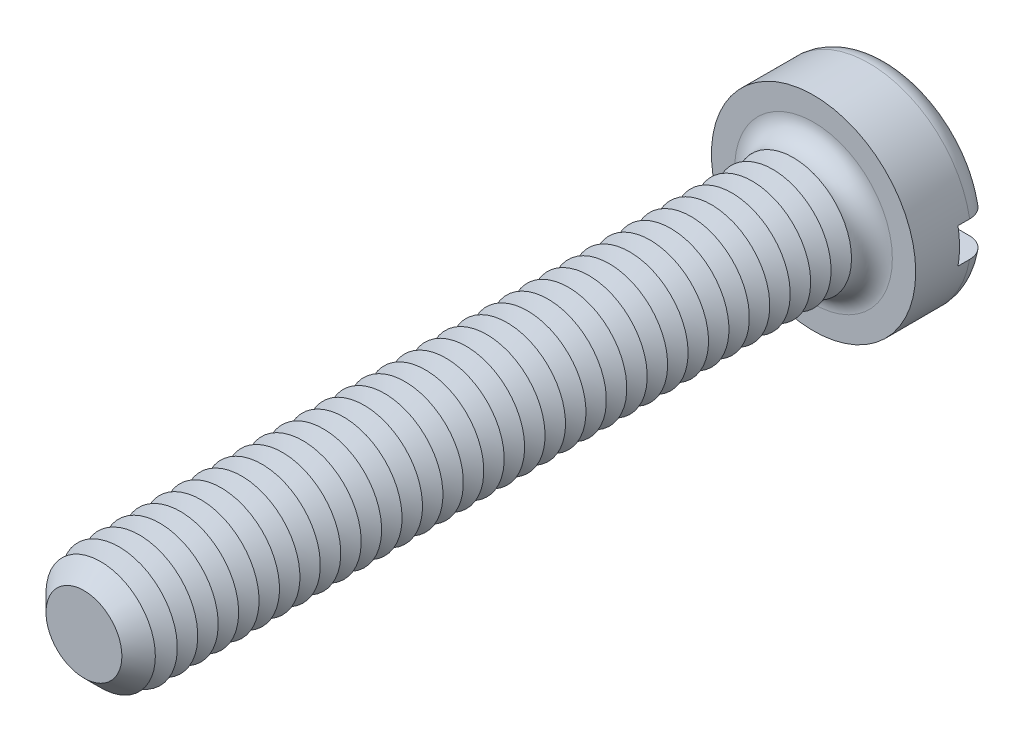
ISO-10303-21;
HEADER;
FILE_DESCRIPTION(('STEP AP214'),'2;1');
FILE_NAME('part.step','',(''),(''),'','','');
FILE_SCHEMA(('AUTOMOTIVE_DESIGN { 1 0 10303 214 1 1 1 1 }'));
ENDSEC;
DATA;
#1=APPLICATION_CONTEXT('core data for automotive mechanical design processes');
#2=APPLICATION_PROTOCOL_DEFINITION('international standard','automotive_design',2000,#1);
#3=PRODUCT_CONTEXT('',#1,'mechanical');
#4=PRODUCT('Part','Part','',(#3));
#5=PRODUCT_RELATED_PRODUCT_CATEGORY('part','',(#4));
#6=PRODUCT_DEFINITION_FORMATION('','',#4);
#7=PRODUCT_DEFINITION_CONTEXT('part definition',#1,'design');
#8=PRODUCT_DEFINITION('design','',#6,#7);
#9=PRODUCT_DEFINITION_SHAPE('','',#8);
#10=(LENGTH_UNIT() NAMED_UNIT(*) SI_UNIT(.MILLI.,.METRE.));
#11=(NAMED_UNIT(*) PLANE_ANGLE_UNIT() SI_UNIT($,.RADIAN.));
#12=(NAMED_UNIT(*) SI_UNIT($,.STERADIAN.) SOLID_ANGLE_UNIT());
#13=UNCERTAINTY_MEASURE_WITH_UNIT(LENGTH_MEASURE(1.E-05),#10,'distance_accuracy_value','');
#14=(GEOMETRIC_REPRESENTATION_CONTEXT(3) GLOBAL_UNCERTAINTY_ASSIGNED_CONTEXT((#13)) GLOBAL_UNIT_ASSIGNED_CONTEXT((#10,
#11,#12)) REPRESENTATION_CONTEXT('',''));
#15=CARTESIAN_POINT('',(0.,0.,0.));
#16=DIRECTION('',(0.,0.,1.));
#17=DIRECTION('',(1.,0.,0.));
#18=AXIS2_PLACEMENT_3D('',#15,#16,#17);
#19=CARTESIAN_POINT('',(0.,0.,-2.6));
#20=DIRECTION('',(0.,0.,1.));
#21=DIRECTION('',(1.,0.,0.));
#22=AXIS2_PLACEMENT_3D('',#19,#20,#21);
#23=PLANE('',#22);
#24=CARTESIAN_POINT('',(0.,0.,-2.6));
#25=DIRECTION('',(0.,0.,1.));
#26=DIRECTION('',(1.,0.,0.));
#27=AXIS2_PLACEMENT_3D('',#24,#25,#26);
#28=CIRCLE('',#27,2.8);
#29=CARTESIAN_POINT('',(-2.73495886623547,0.6,-2.6));
#30=VERTEX_POINT('',#29);
#31=CARTESIAN_POINT('',(2.73495886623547,0.6,-2.6));
#32=VERTEX_POINT('',#31);
#33=EDGE_CURVE('E116',#30,#32,#28,.F.);
#34=ORIENTED_EDGE('',*,*,#33,.T.);
#35=DIRECTION('',(1.,0.,0.));
#36=VECTOR('',#35,1.);
#37=CARTESIAN_POINT('',(-3.5,0.600000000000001,-2.6));
#38=LINE('',#37,#36);
#39=EDGE_CURVE('E111',#30,#32,#38,.T.);
#40=ORIENTED_EDGE('',*,*,#39,.F.);
#41=EDGE_LOOP('',(#34,#40));
#42=FACE_BOUND('',#41,.T.);
#43=ADVANCED_FACE('F39',(#42),#23,.F.);
#44=CARTESIAN_POINT('',(0.,0.,-1.9));
#45=DIRECTION('',(0.,0.,1.));
#46=DIRECTION('',(1.,0.,0.));
#47=AXIS2_PLACEMENT_3D('',#44,#45,#46);
#48=TOROIDAL_SURFACE('',#47,2.8,0.7);
#49=CARTESIAN_POINT('',(-3.24550494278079,0.600000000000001,-2.38938679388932));
#50=CARTESIAN_POINT('',(-3.21724139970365,0.600000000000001,-2.41780774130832));
#51=CARTESIAN_POINT('',(-3.18652103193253,0.600000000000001,-2.44383169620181));
#52=CARTESIAN_POINT('',(-3.12110229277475,0.600000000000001,-2.49034599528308));
#53=CARTESIAN_POINT('',(-3.08639834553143,0.6,-2.51082844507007));
#54=CARTESIAN_POINT('',(-3.01410013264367,0.6,-2.54568075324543));
#55=CARTESIAN_POINT('',(-2.97650963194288,0.6,-2.56005841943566));
#56=CARTESIAN_POINT('',(-2.89948250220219,0.6,-2.58239238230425));
#57=CARTESIAN_POINT('',(-2.86004633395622,0.6,-2.59035027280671));
#58=CARTESIAN_POINT('',(-2.77983715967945,0.6,-2.5997577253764));
#59=CARTESIAN_POINT('',(-2.73905311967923,0.6,-2.60111317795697));
#60=CARTESIAN_POINT('',(-2.65781876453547,0.6,-2.59706866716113));
#61=CARTESIAN_POINT('',(-2.61736849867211,0.6,-2.59166772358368));
#62=CARTESIAN_POINT('',(-2.53729983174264,0.6,-2.57414594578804));
#63=CARTESIAN_POINT('',(-2.49770360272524,0.6,-2.56192363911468));
#64=CARTESIAN_POINT('',(-2.421111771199,0.6,-2.5310238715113));
#65=CARTESIAN_POINT('',(-2.38411632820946,0.6,-2.51234601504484));
#66=CARTESIAN_POINT('',(-2.31371213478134,0.6,-2.46896762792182));
#67=CARTESIAN_POINT('',(-2.28031240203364,0.6,-2.44425244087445));
#68=CARTESIAN_POINT('',(-2.21823311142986,0.6,-2.38946667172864));
#69=CARTESIAN_POINT('',(-2.18955321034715,0.6,-2.35939647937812));
#70=CARTESIAN_POINT('',(-2.13836074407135,0.6,-2.29532787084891));
#71=CARTESIAN_POINT('',(-2.11574147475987,0.6,-2.26141482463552));
#72=CARTESIAN_POINT('',(-2.07677080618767,0.6,-2.19015935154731));
#73=CARTESIAN_POINT('',(-2.06041784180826,0.6,-2.15281778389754));
#74=CARTESIAN_POINT('',(-2.03508596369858,0.6,-2.07723332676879));
#75=CARTESIAN_POINT('',(-2.02585871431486,0.6,-2.03907365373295));
#76=CARTESIAN_POINT('',(-2.01416722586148,0.6,-1.96173417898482));
#77=CARTESIAN_POINT('',(-2.01170151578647,0.6,-1.92255460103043));
#78=CARTESIAN_POINT('',(-2.01359934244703,0.6,-1.84555709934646));
#79=CARTESIAN_POINT('',(-2.01775787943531,0.6,-1.80773393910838));
#80=CARTESIAN_POINT('',(-2.03236373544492,0.6,-1.73332511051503));
#81=CARTESIAN_POINT('',(-2.04281097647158,0.6,-1.69673942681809));
#82=CARTESIAN_POINT('',(-2.06962963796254,0.6,-1.62577336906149));
#83=CARTESIAN_POINT('',(-2.08600685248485,0.6,-1.59139519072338));
#84=CARTESIAN_POINT('',(-2.12413495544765,0.6,-1.52576356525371));
#85=CARTESIAN_POINT('',(-2.14588657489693,0.6,-1.49451054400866));
#86=CARTESIAN_POINT('',(-2.19483541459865,0.6,-1.43498643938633));
#87=CARTESIAN_POINT('',(-2.22217844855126,0.6,-1.40683532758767));
#88=CARTESIAN_POINT('',(-2.28105616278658,0.6,-1.35532544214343));
#89=CARTESIAN_POINT('',(-2.3125916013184,0.6,-1.33196753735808));
#90=CARTESIAN_POINT('',(-2.38018779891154,0.6,-1.28984356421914));
#91=CARTESIAN_POINT('',(-2.41637068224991,0.6,-1.27127330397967));
#92=CARTESIAN_POINT('',(-2.49129688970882,0.6,-1.24032971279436));
#93=CARTESIAN_POINT('',(-2.53004053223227,0.6,-1.22795715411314));
#94=CARTESIAN_POINT('',(-2.6098393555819,0.6,-1.2095515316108));
#95=CARTESIAN_POINT('',(-2.65092550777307,0.6,-1.20365237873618));
#96=CARTESIAN_POINT('',(-2.7335069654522,0.6,-1.1988380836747));
#97=CARTESIAN_POINT('',(-2.7750022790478,0.6,-1.19992308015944));
#98=CARTESIAN_POINT('',(-2.85718851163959,0.6,-1.20909046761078));
#99=CARTESIAN_POINT('',(-2.8978799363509,0.6,-1.21716830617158));
#100=CARTESIAN_POINT('',(-2.97729176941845,0.6,-1.24014327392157));
#101=CARTESIAN_POINT('',(-3.01601231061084,0.6,-1.25503994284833));
#102=CARTESIAN_POINT('',(-3.08976822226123,0.6,-1.29101066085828));
#103=CARTESIAN_POINT('',(-3.12484927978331,0.600000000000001,-1.31199098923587));
#104=CARTESIAN_POINT('',(-3.19090022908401,0.600000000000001,-1.35965144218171));
#105=CARTESIAN_POINT('',(-3.22187053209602,0.600000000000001,-1.38633099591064));
#106=CARTESIAN_POINT('',(-3.2781946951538,0.600000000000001,-1.44408564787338));
#107=CARTESIAN_POINT('',(-3.3036441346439,0.600000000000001,-1.47506754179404));
#108=CARTESIAN_POINT('',(-3.34887649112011,0.600000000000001,-1.54092398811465));
#109=CARTESIAN_POINT('',(-3.36865993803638,0.600000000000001,-1.57579817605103));
#110=CARTESIAN_POINT('',(-3.40166738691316,0.600000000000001,-1.64783067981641));
#111=CARTESIAN_POINT('',(-3.41499360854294,0.600000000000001,-1.68494217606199));
#112=CARTESIAN_POINT('',(-3.43515375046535,0.600000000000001,-1.76088675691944));
#113=CARTESIAN_POINT('',(-3.44198836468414,0.600000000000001,-1.79971965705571));
#114=CARTESIAN_POINT('',(-3.44891916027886,0.600000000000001,-1.87757893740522));
#115=CARTESIAN_POINT('',(-3.44908375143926,0.600000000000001,-1.91659924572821));
#116=CARTESIAN_POINT('',(-3.44284111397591,0.600000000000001,-1.99412088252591));
#117=CARTESIAN_POINT('',(-3.43643236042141,0.600000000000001,-2.03262208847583));
#118=CARTESIAN_POINT('',(-3.41725803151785,0.600000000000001,-2.10792315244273));
#119=CARTESIAN_POINT('',(-3.40450469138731,0.600000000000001,-2.14472613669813));
#120=CARTESIAN_POINT('',(-3.3730385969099,0.600000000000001,-2.21565060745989));
#121=CARTESIAN_POINT('',(-3.35433321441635,0.600000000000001,-2.24977534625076));
#122=CARTESIAN_POINT('',(-3.3201892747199,0.600000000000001,-2.30136364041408));
#123=CARTESIAN_POINT('',(-3.30647805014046,0.600000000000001,-2.31999402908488));
#124=CARTESIAN_POINT('',(-3.27728518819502,0.600000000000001,-2.35581090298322));
#125=CARTESIAN_POINT('',(-3.26180356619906,0.600000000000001,-2.37299740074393));
#126=CARTESIAN_POINT('',(-3.24550494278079,0.600000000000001,-2.38938679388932));
#127=B_SPLINE_CURVE_WITH_KNOTS('',3,(#49,#50,#51,#52,#53,#54,#55,#56,#57,#58,#59,#60,#61,#62,
#63,#64,#65,#66,#67,#68,#69,#70,#71,#72,#73,#74,#75,#76,#77,#78,#79,#80,#81,#82,#83,#84,#85,#86,
#87,#88,#89,#90,#91,#92,#93,#94,#95,#96,#97,#98,#99,#100,#101,#102,#103,#104,#105,#106,#107,
#108,#109,#110,#111,#112,#113,#114,#115,#116,#117,#118,#119,#120,#121,#122,#123,#124,#125,#126),
.UNSPECIFIED.,.T.,.F.,(4,2,2,2,2,2,2,2,2,2,2,2,2,2,2,2,2,2,2,2,2,2,2,2,2,2,2,2,2,2,2,2,2,2,2,2,
2,2,4),(0.,0.120160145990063,0.240490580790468,0.36066665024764,0.480812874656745,
0.602666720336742,0.724538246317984,0.848272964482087,0.972015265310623,1.09606100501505,
1.2200977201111,1.34178071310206,1.46343329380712,1.58062647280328,1.6977941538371,
1.81140573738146,1.92501591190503,2.03873739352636,2.15247435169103,2.26967910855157,
2.38690509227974,2.50835551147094,2.62982106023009,2.75375450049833,2.87769040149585,
3.00154567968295,3.12539259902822,3.24742469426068,3.36944457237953,3.48914477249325,
3.60883377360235,3.72656056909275,3.84427477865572,3.96078136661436,4.07731498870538,
4.19362474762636,4.3097910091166,4.37908387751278,4.44837614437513),.UNSPECIFIED.);
#128=CARTESIAN_POINT('',(-3.44818792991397,0.600000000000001,-1.8999999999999));
#129=VERTEX_POINT('',#128);
#130=EDGE_CURVE('E457',#129,#30,#127,.T.);
#131=ORIENTED_EDGE('',*,*,#130,.F.);
#132=CARTESIAN_POINT('',(0.,0.,-1.9));
#133=DIRECTION('',(0.,0.,1.));
#134=DIRECTION('',(1.,0.,0.));
#135=AXIS2_PLACEMENT_3D('',#132,#133,#134);
#136=CIRCLE('',#135,3.5);
#137=CARTESIAN_POINT('',(3.44818792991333,0.6,-1.9));
#138=VERTEX_POINT('',#137);
#139=EDGE_CURVE('E125',#138,#129,#136,.T.);
#140=ORIENTED_EDGE('',*,*,#139,.F.);
#141=CARTESIAN_POINT('',(2.1414268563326,0.6,-2.29762171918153));
#142=CARTESIAN_POINT('',(2.16505443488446,0.6,-2.33058245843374));
#143=CARTESIAN_POINT('',(2.19155609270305,0.6,-2.36152717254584));
#144=CARTESIAN_POINT('',(2.24942944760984,0.6,-2.41852964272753));
#145=CARTESIAN_POINT('',(2.28080921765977,0.6,-2.44457913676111));
#146=CARTESIAN_POINT('',(2.34741203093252,0.6,-2.49105381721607));
#147=CARTESIAN_POINT('',(2.38262862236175,0.6,-2.51148824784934));
#148=CARTESIAN_POINT('',(2.45593176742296,0.6,-2.54626881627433));
#149=CARTESIAN_POINT('',(2.49401741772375,0.6,-2.56061686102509));
#150=CARTESIAN_POINT('',(2.57272605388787,0.6,-2.58306429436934));
#151=CARTESIAN_POINT('',(2.6133821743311,0.6,-2.59104769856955));
#152=CARTESIAN_POINT('',(2.6954618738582,0.6,-2.60009608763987));
#153=CARTESIAN_POINT('',(2.73688552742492,0.6,-2.60116039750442));
#154=CARTESIAN_POINT('',(2.81941950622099,0.6,-2.5962925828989));
#155=CARTESIAN_POINT('',(2.86052888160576,0.6,-2.59034422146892));
#156=CARTESIAN_POINT('',(2.94113709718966,0.6,-2.57153687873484));
#157=CARTESIAN_POINT('',(2.98063603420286,0.6,-2.55867831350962));
#158=CARTESIAN_POINT('',(3.05633735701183,0.6,-2.52657771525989));
#159=CARTESIAN_POINT('',(3.09257627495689,0.6,-2.50742188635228));
#160=CARTESIAN_POINT('',(3.16123898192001,0.6,-2.46318606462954));
#161=CARTESIAN_POINT('',(3.19366316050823,0.6,-2.4381066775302));
#162=CARTESIAN_POINT('',(3.25312278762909,0.6,-2.38324481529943));
#163=CARTESIAN_POINT('',(3.28024842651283,0.6,-2.35356008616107));
#164=CARTESIAN_POINT('',(3.32902587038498,0.6,-2.28998971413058));
#165=CARTESIAN_POINT('',(3.35067820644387,0.6,-2.25610447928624));
#166=CARTESIAN_POINT('',(3.38751207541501,0.6,-2.18572286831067));
#167=CARTESIAN_POINT('',(3.40279804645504,0.6,-2.14928112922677));
#168=CARTESIAN_POINT('',(3.42695590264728,0.6,-2.07433042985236));
#169=CARTESIAN_POINT('',(3.43582824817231,0.6,-2.03582161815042));
#170=CARTESIAN_POINT('',(3.44682113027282,0.6,-1.95829536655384));
#171=CARTESIAN_POINT('',(3.44901648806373,0.6,-1.91928851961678));
#172=CARTESIAN_POINT('',(3.44680085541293,0.6,-1.84146366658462));
#173=CARTESIAN_POINT('',(3.44239008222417,0.6,-1.80264565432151));
#174=CARTESIAN_POINT('',(3.42712544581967,0.6,-1.72644634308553));
#175=CARTESIAN_POINT('',(3.41629508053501,0.6,-1.6890603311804));
#176=CARTESIAN_POINT('',(3.38853757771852,0.6,-1.61662604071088));
#177=CARTESIAN_POINT('',(3.37161039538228,0.6,-1.58157777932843));
#178=CARTESIAN_POINT('',(3.33207798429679,0.6,-1.51464178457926));
#179=CARTESIAN_POINT('',(3.30944854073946,0.6,-1.48276835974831));
#180=CARTESIAN_POINT('',(3.2592165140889,0.6,-1.42321861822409));
#181=CARTESIAN_POINT('',(3.23161370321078,0.6,-1.3955424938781));
#182=CARTESIAN_POINT('',(3.17188519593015,0.6,-1.34481834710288));
#183=CARTESIAN_POINT('',(3.13971065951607,0.6,-1.32182785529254));
#184=CARTESIAN_POINT('',(3.07201123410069,0.6,-1.28147003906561));
#185=CARTESIAN_POINT('',(3.03648608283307,0.6,-1.26410315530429));
#186=CARTESIAN_POINT('',(2.962449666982,0.6,-1.2351645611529));
#187=CARTESIAN_POINT('',(2.92389781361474,0.6,-1.22369671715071));
#188=CARTESIAN_POINT('',(2.84543273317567,0.6,-1.20726565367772));
#189=CARTESIAN_POINT('',(2.80551936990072,0.6,-1.20230308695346));
#190=CARTESIAN_POINT('',(2.72467191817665,0.6,-1.1989357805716));
#191=CARTESIAN_POINT('',(2.68373266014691,0.6,-1.20065484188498));
#192=CARTESIAN_POINT('',(2.60270222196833,0.6,-1.21084560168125));
#193=CARTESIAN_POINT('',(2.56261112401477,0.6,-1.21931795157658));
#194=CARTESIAN_POINT('',(2.48385954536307,0.6,-1.24292934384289));
#195=CARTESIAN_POINT('',(2.44522508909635,0.6,-1.25815531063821));
#196=CARTESIAN_POINT('',(2.37106165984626,0.6,-1.29488663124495));
#197=CARTESIAN_POINT('',(2.33553282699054,0.6,-1.31639226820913));
#198=CARTESIAN_POINT('',(2.2686996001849,0.6,-1.36507949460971));
#199=CARTESIAN_POINT('',(2.23738745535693,0.6,-1.39225042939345));
#200=CARTESIAN_POINT('',(2.17990424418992,0.6,-1.45157941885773));
#201=CARTESIAN_POINT('',(2.15373259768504,0.6,-1.48373691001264));
#202=CARTESIAN_POINT('',(2.10799355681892,0.6,-1.551327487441));
#203=CARTESIAN_POINT('',(2.08828258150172,0.6,-1.58666329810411));
#204=CARTESIAN_POINT('',(2.05534440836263,0.6,-1.66023600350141));
#205=CARTESIAN_POINT('',(2.042115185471,0.6,-1.6984719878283));
#206=CARTESIAN_POINT('',(2.02303126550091,0.6,-1.77519783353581));
#207=CARTESIAN_POINT('',(2.01691541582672,0.6,-1.8136228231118));
#208=CARTESIAN_POINT('',(2.01140375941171,0.6,-1.89096056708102));
#209=CARTESIAN_POINT('',(2.01200856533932,0.6,-1.92987336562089));
#210=CARTESIAN_POINT('',(2.01981617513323,0.6,-2.006065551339));
#211=CARTESIAN_POINT('',(2.02685835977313,0.6,-2.04336165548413));
#212=CARTESIAN_POINT('',(2.0470502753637,0.6,-2.1162250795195));
#213=CARTESIAN_POINT('',(2.06019252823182,0.6,-2.15179445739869));
#214=CARTESIAN_POINT('',(2.08525738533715,0.6,-2.20558874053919));
#215=CARTESIAN_POINT('',(2.09529161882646,0.6,-2.22471751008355));
#216=CARTESIAN_POINT('',(2.11708813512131,0.6,-2.26196179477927));
#217=CARTESIAN_POINT('',(2.12885034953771,0.6,-2.28007734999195));
#218=CARTESIAN_POINT('',(2.1414268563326,0.6,-2.29762171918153));
#219=B_SPLINE_CURVE_WITH_KNOTS('',3,(#141,#142,#143,#144,#145,#146,#147,#148,#149,#150,#151,
#152,#153,#154,#155,#156,#157,#158,#159,#160,#161,#162,#163,#164,#165,#166,#167,#168,#169,#170,
#171,#172,#173,#174,#175,#176,#177,#178,#179,#180,#181,#182,#183,#184,#185,#186,#187,#188,#189,
#190,#191,#192,#193,#194,#195,#196,#197,#198,#199,#200,#201,#202,#203,#204,#205,#206,#207,#208,
#209,#210,#211,#212,#213,#214,#215,#216,#217,#218),.UNSPECIFIED.,.T.,.F.,(4,2,2,2,2,2,2,2,2,2,2,
2,2,2,2,2,2,2,2,2,2,2,2,2,2,2,2,2,2,2,2,2,2,2,2,2,2,2,4),(0.,0.121582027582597,
0.243367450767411,0.364951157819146,0.486496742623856,0.610209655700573,0.733934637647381,
0.857946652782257,0.981951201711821,1.1043243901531,1.22668507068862,1.34673532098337,
1.46677391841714,1.58475736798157,1.70273234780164,1.81938035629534,1.93602452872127,
2.05224435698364,2.168465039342,2.28518782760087,2.40191596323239,2.52000081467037,
2.63809491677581,2.75820270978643,2.87832255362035,3.00067856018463,3.1230463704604,
3.24703703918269,3.37103329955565,3.49479843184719,3.6185495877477,3.73932715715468,
3.86006696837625,3.9762182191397,4.09238005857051,4.2057203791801,4.31892212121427,
4.38364046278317,4.44835624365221),.UNSPECIFIED.);
#220=EDGE_CURVE('E459',#32,#138,#219,.T.);
#221=ORIENTED_EDGE('',*,*,#220,.F.);
#222=ORIENTED_EDGE('',*,*,#33,.F.);
#223=EDGE_LOOP('',(#131,#140,#221,#222));
#224=FACE_BOUND('',#223,.T.);
#225=ADVANCED_FACE('F441',(#224),#48,.T.);
#226=CARTESIAN_POINT('',(0.,0.,-2.6));
#227=DIRECTION('',(0.,0.,1.));
#228=DIRECTION('',(1.,0.,0.));
#229=AXIS2_PLACEMENT_3D('',#226,#227,#228);
#230=CYLINDRICAL_SURFACE('',#229,3.5);
#231=DIRECTION('',(0.,0.,1.));
#232=VECTOR('',#231,1.);
#233=CARTESIAN_POINT('',(3.44818792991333,0.6,-2.6));
#234=LINE('',#233,#232);
#235=CARTESIAN_POINT('',(3.44818792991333,0.6,-1.5));
#236=VERTEX_POINT('',#235);
#237=EDGE_CURVE('E473',#138,#236,#234,.T.);
#238=ORIENTED_EDGE('',*,*,#237,.F.);
#239=ORIENTED_EDGE('',*,*,#139,.T.);
#240=DIRECTION('',(0.,0.,1.));
#241=VECTOR('',#240,1.);
#242=CARTESIAN_POINT('',(-3.44818792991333,0.600000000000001,-2.6));
#243=LINE('',#242,#241);
#244=CARTESIAN_POINT('',(-3.44818792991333,0.600000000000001,-1.5));
#245=VERTEX_POINT('',#244);
#246=EDGE_CURVE('E63',#245,#129,#243,.F.);
#247=ORIENTED_EDGE('',*,*,#246,.F.);
#248=CARTESIAN_POINT('',(0.,0.,-1.5));
#249=DIRECTION('',(0.,0.,-1.));
#250=DIRECTION('',(-1.,0.,0.));
#251=AXIS2_PLACEMENT_3D('',#248,#249,#250);
#252=CIRCLE('',#251,3.5);
#253=CARTESIAN_POINT('',(-3.44818792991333,-0.599999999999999,-1.5));
#254=VERTEX_POINT('',#253);
#255=EDGE_CURVE('E43',#245,#254,#252,.F.);
#256=ORIENTED_EDGE('',*,*,#255,.T.);
#257=DIRECTION('',(0.,0.,1.));
#258=VECTOR('',#257,1.);
#259=CARTESIAN_POINT('',(-3.44818792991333,-0.599999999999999,-2.6));
#260=LINE('',#259,#258);
#261=CARTESIAN_POINT('',(-3.44818792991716,-0.599999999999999,-1.90000000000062));
#262=VERTEX_POINT('',#261);
#263=EDGE_CURVE('E470',#262,#254,#260,.T.);
#264=ORIENTED_EDGE('',*,*,#263,.F.);
#265=CARTESIAN_POINT('',(3.44818792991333,-0.6,-1.9));
#266=VERTEX_POINT('',#265);
#267=EDGE_CURVE('E127',#262,#266,#136,.T.);
#268=ORIENTED_EDGE('',*,*,#267,.T.);
#269=DIRECTION('',(0.,0.,1.));
#270=VECTOR('',#269,1.);
#271=CARTESIAN_POINT('',(3.44818792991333,-0.6,-2.6));
#272=LINE('',#271,#270);
#273=CARTESIAN_POINT('',(3.44818792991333,-0.6,-1.5));
#274=VERTEX_POINT('',#273);
#275=EDGE_CURVE('E55',#274,#266,#272,.F.);
#276=ORIENTED_EDGE('',*,*,#275,.F.);
#277=EDGE_CURVE('E11',#274,#236,#252,.F.);
#278=ORIENTED_EDGE('',*,*,#277,.T.);
#279=EDGE_LOOP('',(#238,#239,#247,#256,#264,#268,#276,#278));
#280=FACE_BOUND('',#279,.T.);
#281=CARTESIAN_POINT('',(0.,0.,0.));
#282=DIRECTION('',(0.,0.,1.));
#283=DIRECTION('',(1.,0.,0.));
#284=AXIS2_PLACEMENT_3D('',#281,#282,#283);
#285=CIRCLE('',#284,3.5);
#286=CARTESIAN_POINT('',(3.5,0.,0.));
#287=VERTEX_POINT('',#286);
#288=EDGE_CURVE('E476',#287,#287,#285,.T.);
#289=ORIENTED_EDGE('',*,*,#288,.F.);
#290=EDGE_LOOP('',(#289));
#291=FACE_BOUND('',#290,.T.);
#292=ADVANCED_FACE('F437',(#280,#291),#230,.T.);
#293=CARTESIAN_POINT('',(2.73495886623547,-0.6,-2.6));
#294=VERTEX_POINT('',#293);
#295=CARTESIAN_POINT('',(-2.73495886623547,-0.6,-2.6));
#296=VERTEX_POINT('',#295);
#297=EDGE_CURVE('E109',#294,#296,#28,.F.);
#298=ORIENTED_EDGE('',*,*,#297,.T.);
#299=DIRECTION('',(-1.,0.,0.));
#300=VECTOR('',#299,1.);
#301=CARTESIAN_POINT('',(-3.5,-0.599999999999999,-2.6));
#302=LINE('',#301,#300);
#303=EDGE_CURVE('E96',#294,#296,#302,.T.);
#304=ORIENTED_EDGE('',*,*,#303,.F.);
#305=EDGE_LOOP('',(#298,#304));
#306=FACE_BOUND('',#305,.T.);
#307=ADVANCED_FACE('F108',(#306),#23,.F.);
#308=CARTESIAN_POINT('',(0.,0.,0.));
#309=DIRECTION('',(0.,0.,1.));
#310=DIRECTION('',(1.,0.,0.));
#311=AXIS2_PLACEMENT_3D('',#308,#309,#310);
#312=PLANE('',#311);
#313=CARTESIAN_POINT('',(0.,0.,0.));
#314=DIRECTION('',(0.,0.,1.));
#315=DIRECTION('',(1.,0.,0.));
#316=AXIS2_PLACEMENT_3D('',#313,#314,#315);
#317=CIRCLE('',#316,2.7);
#318=CARTESIAN_POINT('',(2.7,0.,0.));
#319=VERTEX_POINT('',#318);
#320=EDGE_CURVE('E115',#319,#319,#317,.F.);
#321=ORIENTED_EDGE('',*,*,#320,.T.);
#322=EDGE_LOOP('',(#321));
#323=FACE_BOUND('',#322,.T.);
#324=ORIENTED_EDGE('',*,*,#288,.T.);
#325=EDGE_LOOP('',(#324));
#326=FACE_BOUND('',#325,.T.);
#327=ADVANCED_FACE('F436',(#323,#326),#312,.T.);
#328=CARTESIAN_POINT('',(-3.24550494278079,-0.599999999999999,-2.38938679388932));
#329=CARTESIAN_POINT('',(-3.27309693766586,-0.599999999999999,-2.36163611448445));
#330=CARTESIAN_POINT('',(-3.29838741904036,-0.599999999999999,-2.3315608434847));
#331=CARTESIAN_POINT('',(-3.34359429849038,-0.599999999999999,-2.26757659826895));
#332=CARTESIAN_POINT('',(-3.36350518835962,-0.599999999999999,-2.23366374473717));
#333=CARTESIAN_POINT('',(-3.39733065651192,-0.599999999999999,-2.16296274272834));
#334=CARTESIAN_POINT('',(-3.4112451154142,-0.599999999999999,-2.12617453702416));
#335=CARTESIAN_POINT('',(-3.43264462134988,-0.599999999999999,-2.05078178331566));
#336=CARTESIAN_POINT('',(-3.44013114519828,-0.599999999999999,-2.01217765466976));
#337=CARTESIAN_POINT('',(-3.44841975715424,-0.599999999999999,-1.9345391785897));
#338=CARTESIAN_POINT('',(-3.44926944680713,-0.599999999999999,-1.89550990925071));
#339=CARTESIAN_POINT('',(-3.44438358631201,-0.599999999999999,-1.81786552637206));
#340=CARTESIAN_POINT('',(-3.43864801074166,-0.599999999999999,-1.77925041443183));
#341=CARTESIAN_POINT('',(-3.42079221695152,-0.599999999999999,-1.70364264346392));
#342=CARTESIAN_POINT('',(-3.40869011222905,-0.599999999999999,-1.66664570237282));
#343=CARTESIAN_POINT('',(-3.37847692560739,-0.599999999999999,-1.59519424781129));
#344=CARTESIAN_POINT('',(-3.3603657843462,-0.599999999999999,-1.56073975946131));
#345=CARTESIAN_POINT('',(-3.31856549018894,-0.599999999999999,-1.4951524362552));
#346=CARTESIAN_POINT('',(-3.29484830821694,-0.599999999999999,-1.46403747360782));
#347=CARTESIAN_POINT('',(-3.24258489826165,-0.599999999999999,-1.40617131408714));
#348=CARTESIAN_POINT('',(-3.21403843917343,-0.599999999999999,-1.37942032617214));
#349=CARTESIAN_POINT('',(-3.15256084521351,-0.599999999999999,-1.33067963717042));
#350=CARTESIAN_POINT('',(-3.11958015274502,-0.599999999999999,-1.30875246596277));
#351=CARTESIAN_POINT('',(-3.0504559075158,-0.599999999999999,-1.27063718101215));
#352=CARTESIAN_POINT('',(-3.01431209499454,-0.6,-1.25444953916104));
#353=CARTESIAN_POINT('',(-2.93921710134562,-0.6,-1.22796796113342));
#354=CARTESIAN_POINT('',(-2.90022796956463,-0.6,-1.217781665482));
#355=CARTESIAN_POINT('',(-2.82110512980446,-0.6,-1.20396915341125));
#356=CARTESIAN_POINT('',(-2.7809713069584,-0.6,-1.2003435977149));
#357=CARTESIAN_POINT('',(-2.69990924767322,-0.6,-1.19969717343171));
#358=CARTESIAN_POINT('',(-2.65898001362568,-0.6,-1.20279937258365));
#359=CARTESIAN_POINT('',(-2.57819986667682,-0.6,-1.21574287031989));
#360=CARTESIAN_POINT('',(-2.53834905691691,-0.6,-1.22558481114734));
#361=CARTESIAN_POINT('',(-2.46035232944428,-0.6,-1.25189361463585));
#362=CARTESIAN_POINT('',(-2.42223314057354,-0.6,-1.2684398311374));
#363=CARTESIAN_POINT('',(-2.34932316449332,-0.6,-1.30771928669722));
#364=CARTESIAN_POINT('',(-2.31453248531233,-0.6,-1.33045272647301));
#365=CARTESIAN_POINT('',(-2.24945577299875,-0.6,-1.38141543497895));
#366=CARTESIAN_POINT('',(-2.21915255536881,-0.6,-1.40962272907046));
#367=CARTESIAN_POINT('',(-2.16386461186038,-0.6,-1.47084552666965));
#368=CARTESIAN_POINT('',(-2.13887916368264,-0.6,-1.50386037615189));
#369=CARTESIAN_POINT('',(-2.09568071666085,-0.6,-1.57285917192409));
#370=CARTESIAN_POINT('',(-2.07730739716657,-0.6,-1.60874263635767));
#371=CARTESIAN_POINT('',(-2.04712019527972,-0.6,-1.68316975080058));
#372=CARTESIAN_POINT('',(-2.03530452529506,-0.6,-1.72171267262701));
#373=CARTESIAN_POINT('',(-2.01901751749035,-0.6,-1.79878952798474));
#374=CARTESIAN_POINT('',(-2.01428434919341,-0.6,-1.8372682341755));
#375=CARTESIAN_POINT('',(-2.01150652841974,-0.6,-1.91446369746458));
#376=CARTESIAN_POINT('',(-2.01346084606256,-0.6,-1.95318041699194));
#377=CARTESIAN_POINT('',(-2.02386268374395,-0.6,-2.0288619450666));
#378=CARTESIAN_POINT('',(-2.03216724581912,-0.6,-2.06584654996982));
#379=CARTESIAN_POINT('',(-2.05479337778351,-0.6,-2.13792373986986));
#380=CARTESIAN_POINT('',(-2.06911522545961,-0.6,-2.1730162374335));
#381=CARTESIAN_POINT('',(-2.10349906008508,-0.6,-2.24081034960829));
#382=CARTESIAN_POINT('',(-2.12363007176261,-0.6,-2.27347689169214));
#383=CARTESIAN_POINT('',(-2.16891308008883,-0.6,-2.33511902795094));
#384=CARTESIAN_POINT('',(-2.19406590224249,-0.6,-2.36409401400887));
#385=CARTESIAN_POINT('',(-2.24962389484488,-0.6,-2.41861972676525));
#386=CARTESIAN_POINT('',(-2.28018314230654,-0.6,-2.44401345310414));
#387=CARTESIAN_POINT('',(-2.34501720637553,-0.6,-2.48950558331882));
#388=CARTESIAN_POINT('',(-2.37929266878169,-0.6,-2.50960306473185));
#389=CARTESIAN_POINT('',(-2.45179417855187,-0.6,-2.54458276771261));
#390=CARTESIAN_POINT('',(-2.49011248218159,-0.6,-2.55927401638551));
#391=CARTESIAN_POINT('',(-2.56865227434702,-0.6,-2.58211133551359));
#392=CARTESIAN_POINT('',(-2.60887386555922,-0.6,-2.59025705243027));
#393=CARTESIAN_POINT('',(-2.69064746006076,-0.6,-2.59982905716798));
#394=CARTESIAN_POINT('',(-2.73220999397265,-0.6,-2.60116580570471));
#395=CARTESIAN_POINT('',(-2.81497658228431,-0.6,-2.59679700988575));
#396=CARTESIAN_POINT('',(-2.85618055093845,-0.6,-2.59108982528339));
#397=CARTESIAN_POINT('',(-2.93677683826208,-0.6,-2.57279487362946));
#398=CARTESIAN_POINT('',(-2.97617834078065,-0.6,-2.56024753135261));
#399=CARTESIAN_POINT('',(-3.05222242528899,-0.6,-2.52860709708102));
#400=CARTESIAN_POINT('',(-3.08886850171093,-0.599999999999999,-2.50952247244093));
#401=CARTESIAN_POINT('',(-3.14562501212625,-0.599999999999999,-2.47340693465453));
#402=CARTESIAN_POINT('',(-3.16689358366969,-0.599999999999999,-2.45816337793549));
#403=CARTESIAN_POINT('',(-3.20761866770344,-0.599999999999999,-2.42542115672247));
#404=CARTESIAN_POINT('',(-3.22707520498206,-0.599999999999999,-2.40792252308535));
#405=CARTESIAN_POINT('',(-3.24550494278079,-0.599999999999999,-2.38938679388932));
#406=B_SPLINE_CURVE_WITH_KNOTS('',3,(#328,#329,#330,#331,#332,#333,#334,#335,#336,#337,#338,
#339,#340,#341,#342,#343,#344,#345,#346,#347,#348,#349,#350,#351,#352,#353,#354,#355,#356,#357,
#358,#359,#360,#361,#362,#363,#364,#365,#366,#367,#368,#369,#370,#371,#372,#373,#374,#375,#376,
#377,#378,#379,#380,#381,#382,#383,#384,#385,#386,#387,#388,#389,#390,#391,#392,#393,#394,#395,
#396,#397,#398,#399,#400,#401,#402,#403,#404,#405),.UNSPECIFIED.,.T.,.F.,(4,2,2,2,2,2,2,2,2,2,2,
2,2,2,2,2,2,2,2,2,2,2,2,2,2,2,2,2,2,2,2,2,2,2,2,2,2,2,4),(0.,0.117306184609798,
0.234732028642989,0.352160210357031,0.469561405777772,0.586119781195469,0.702678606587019,
0.818907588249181,0.935137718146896,1.05196174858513,1.1687913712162,1.2870562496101,
1.40533084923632,1.52566688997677,1.64601504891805,1.76858322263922,1.89116307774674,
2.01523830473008,2.13931755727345,2.26290863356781,2.38648291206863,2.50681878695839,
2.62712184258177,2.74285697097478,2.85857427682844,2.97176054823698,3.08495204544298,
3.19954814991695,3.31416310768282,3.43282436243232,3.55150627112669,3.67404987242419,
3.79660009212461,3.92075778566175,4.04494439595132,4.16840490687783,4.29170610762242,
4.3700604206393,4.44841366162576),.UNSPECIFIED.);
#407=EDGE_CURVE('E103',#296,#262,#406,.T.);
#408=ORIENTED_EDGE('',*,*,#407,.F.);
#409=ORIENTED_EDGE('',*,*,#297,.F.);
#410=CARTESIAN_POINT('',(2.1414268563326,-0.6,-2.29762171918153));
#411=CARTESIAN_POINT('',(2.11900044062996,-0.6,-2.26633119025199));
#412=CARTESIAN_POINT('',(2.09913154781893,-0.6,-2.23318080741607));
#413=CARTESIAN_POINT('',(2.06517900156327,-0.6,-2.16401111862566));
#414=CARTESIAN_POINT('',(2.05109968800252,-0.6,-2.12798968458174));
#415=CARTESIAN_POINT('',(2.02923593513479,-0.6,-2.05404277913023));
#416=CARTESIAN_POINT('',(2.02145692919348,-0.6,-2.01611569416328));
#417=CARTESIAN_POINT('',(2.01251710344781,-0.6,-1.93949649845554));
#418=CARTESIAN_POINT('',(2.01135461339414,-0.6,-1.90080458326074));
#419=CARTESIAN_POINT('',(2.01564803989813,-0.6,-1.82450508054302));
#420=CARTESIAN_POINT('',(2.02098305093,-0.6,-1.78689061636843));
#421=CARTESIAN_POINT('',(2.03786826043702,-0.6,-1.71308589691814));
#422=CARTESIAN_POINT('',(2.04941870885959,-0.6,-1.67689569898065));
#423=CARTESIAN_POINT('',(2.07838664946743,-0.6,-1.60676639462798));
#424=CARTESIAN_POINT('',(2.09582944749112,-0.6,-1.57283776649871));
#425=CARTESIAN_POINT('',(2.1359925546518,-0.6,-1.50826612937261));
#426=CARTESIAN_POINT('',(2.15871360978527,-0.6,-1.47762358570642));
#427=CARTESIAN_POINT('',(2.20955413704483,-0.6,-1.41943384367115));
#428=CARTESIAN_POINT('',(2.23782364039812,-0.6,-1.39201777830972));
#429=CARTESIAN_POINT('',(2.29842612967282,-0.6,-1.34212199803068));
#430=CARTESIAN_POINT('',(2.33075984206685,-0.6,-1.31964316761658));
#431=CARTESIAN_POINT('',(2.399806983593,-0.6,-1.27945238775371));
#432=CARTESIAN_POINT('',(2.43663466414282,-0.6,-1.26193653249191));
#433=CARTESIAN_POINT('',(2.51267241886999,-0.6,-1.23320660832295));
#434=CARTESIAN_POINT('',(2.55188277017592,-0.6,-1.22199327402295));
#435=CARTESIAN_POINT('',(2.63235000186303,-0.6,-1.20602688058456));
#436=CARTESIAN_POINT('',(2.673631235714,-0.6,-1.20139617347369));
#437=CARTESIAN_POINT('',(2.7563863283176,-0.6,-1.19914622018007));
#438=CARTESIAN_POINT('',(2.79786018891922,-0.6,-1.20152704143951));
#439=CARTESIAN_POINT('',(2.87971192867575,-0.6,-1.21326884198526));
#440=CARTESIAN_POINT('',(2.92009214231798,-0.6,-1.22261349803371));
#441=CARTESIAN_POINT('',(2.99866777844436,-0.6,-1.24805614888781));
#442=CARTESIAN_POINT('',(3.03686335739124,-0.6,-1.26415365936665));
#443=CARTESIAN_POINT('',(3.10934738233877,-0.6,-1.3023912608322));
#444=CARTESIAN_POINT('',(3.14368704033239,-0.6,-1.32443423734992));
#445=CARTESIAN_POINT('',(3.20808395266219,-0.6,-1.37407725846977));
#446=CARTESIAN_POINT('',(3.23814164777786,-0.6,-1.40167673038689));
#447=CARTESIAN_POINT('',(3.29251534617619,-0.6,-1.46108303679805));
#448=CARTESIAN_POINT('',(3.3169296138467,-0.6,-1.49279994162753));
#449=CARTESIAN_POINT('',(3.35998418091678,-0.6,-1.55993706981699));
#450=CARTESIAN_POINT('',(3.37862502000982,-0.6,-1.59535694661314));
#451=CARTESIAN_POINT('',(3.40930212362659,-0.6,-1.668283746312));
#452=CARTESIAN_POINT('',(3.42143897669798,-0.6,-1.70574837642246));
#453=CARTESIAN_POINT('',(3.43918305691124,-0.6,-1.78219297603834));
#454=CARTESIAN_POINT('',(3.44479069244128,-0.6,-1.82117285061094));
#455=CARTESIAN_POINT('',(3.44928173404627,-0.6,-1.89914596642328));
#456=CARTESIAN_POINT('',(3.44822835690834,-0.6,-1.93813558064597));
#457=CARTESIAN_POINT('',(3.43957811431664,-0.6,-2.0153811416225));
#458=CARTESIAN_POINT('',(3.43198139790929,-0.6,-2.05363710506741));
#459=CARTESIAN_POINT('',(3.41049386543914,-0.6,-2.12826741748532));
#460=CARTESIAN_POINT('',(3.39661362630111,-0.6,-2.16464481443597));
#461=CARTESIAN_POINT('',(3.36297924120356,-0.6,-2.23457274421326));
#462=CARTESIAN_POINT('',(3.34322499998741,-0.6,-2.26812323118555));
#463=CARTESIAN_POINT('',(3.29828706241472,-0.6,-2.33167864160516));
#464=CARTESIAN_POINT('',(3.27307040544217,-0.6,-2.36166024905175));
#465=CARTESIAN_POINT('',(3.21802069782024,-0.6,-2.41703165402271));
#466=CARTESIAN_POINT('',(3.18818738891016,-0.6,-2.44242119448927));
#467=CARTESIAN_POINT('',(3.12433871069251,-0.6,-2.48825551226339));
#468=CARTESIAN_POINT('',(3.09027338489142,-0.6,-2.50863067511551));
#469=CARTESIAN_POINT('',(3.01925175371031,-0.6,-2.54348754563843));
#470=CARTESIAN_POINT('',(2.982295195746,-0.6,-2.55796873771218));
#471=CARTESIAN_POINT('',(2.90583499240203,-0.6,-2.58090526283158));
#472=CARTESIAN_POINT('',(2.86629758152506,-0.6,-2.58924801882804));
#473=CARTESIAN_POINT('',(2.78639041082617,-0.6,-2.59930573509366));
#474=CARTESIAN_POINT('',(2.7460205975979,-0.6,-2.60102026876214));
#475=CARTESIAN_POINT('',(2.66482039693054,-0.6,-2.59779078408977));
#476=CARTESIAN_POINT('',(2.62399477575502,-0.6,-2.59272651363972));
#477=CARTESIAN_POINT('',(2.54373809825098,-0.6,-2.57588976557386));
#478=CARTESIAN_POINT('',(2.50430750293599,-0.6,-2.56411509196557));
#479=CARTESIAN_POINT('',(2.42753167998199,-0.6,-2.53401488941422));
#480=CARTESIAN_POINT('',(2.39021407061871,-0.6,-2.51561892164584));
#481=CARTESIAN_POINT('',(2.31925431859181,-0.6,-2.4727929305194));
#482=CARTESIAN_POINT('',(2.28560806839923,-0.6,-2.44836975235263));
#483=CARTESIAN_POINT('',(2.23316677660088,-0.6,-2.40295212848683));
#484=CARTESIAN_POINT('',(2.21309339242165,-0.6,-2.38341311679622));
#485=CARTESIAN_POINT('',(2.17537212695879,-0.6,-2.34211733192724));
#486=CARTESIAN_POINT('',(2.1577241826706,-0.6,-2.32036061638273));
#487=CARTESIAN_POINT('',(2.1414268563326,-0.6,-2.29762171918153));
#488=B_SPLINE_CURVE_WITH_KNOTS('',3,(#410,#411,#412,#413,#414,#415,#416,#417,#418,#419,#420,
#421,#422,#423,#424,#425,#426,#427,#428,#429,#430,#431,#432,#433,#434,#435,#436,#437,#438,#439,
#440,#441,#442,#443,#444,#445,#446,#447,#448,#449,#450,#451,#452,#453,#454,#455,#456,#457,#458,
#459,#460,#461,#462,#463,#464,#465,#466,#467,#468,#469,#470,#471,#472,#473,#474,#475,#476,#477,
#478,#479,#480,#481,#482,#483,#484,#485,#486,#487),.UNSPECIFIED.,.T.,.F.,(4,2,2,2,2,2,2,2,2,2,2,
2,2,2,2,2,2,2,2,2,2,2,2,2,2,2,2,2,2,2,2,2,2,2,2,2,2,2,4),(0.,0.115394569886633,
0.230875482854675,0.346455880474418,0.462007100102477,0.575440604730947,0.688878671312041,
0.802810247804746,0.91675793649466,1.03436780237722,1.15199872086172,1.27377854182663,
1.39557255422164,1.51960202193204,1.64363268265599,1.76737352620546,1.89110549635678,
2.01292743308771,2.13473682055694,2.25423121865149,2.37371444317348,2.49129215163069,
2.60886250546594,2.72531873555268,2.8417723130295,2.95803059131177,3.07429075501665,
3.19127301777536,3.30826182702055,3.42679321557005,3.54533497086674,3.66599996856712,
3.78667273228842,3.90951478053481,4.03239705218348,4.15662720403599,4.28071691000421,
4.36457658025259,4.44843407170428),.UNSPECIFIED.);
#489=EDGE_CURVE('E92',#266,#294,#488,.T.);
#490=ORIENTED_EDGE('',*,*,#489,.F.);
#491=ORIENTED_EDGE('',*,*,#267,.F.);
#492=EDGE_LOOP('',(#408,#409,#490,#491));
#493=FACE_BOUND('',#492,.T.);
#494=ADVANCED_FACE('F113',(#493),#48,.T.);
#495=CARTESIAN_POINT('',(0.,0.,0.699999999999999));
#496=DIRECTION('',(0.,0.,1.));
#497=DIRECTION('',(1.,0.,0.));
#498=AXIS2_PLACEMENT_3D('',#495,#496,#497);
#499=TOROIDAL_SURFACE('',#498,2.7,0.7);
#500=ORIENTED_EDGE('',*,*,#320,.F.);
#501=EDGE_LOOP('',(#500));
#502=FACE_BOUND('',#501,.T.);
#503=CARTESIAN_POINT('',(0.,0.,0.699999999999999));
#504=DIRECTION('',(0.,0.,-1.));
#505=DIRECTION('',(-1.,0.,0.));
#506=AXIS2_PLACEMENT_3D('',#503,#504,#505);
#507=CIRCLE('',#506,2.);
#508=CARTESIAN_POINT('',(-2.,0.,0.699999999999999));
#509=VERTEX_POINT('',#508);
#510=EDGE_CURVE('E480',#509,#509,#507,.T.);
#511=ORIENTED_EDGE('',*,*,#510,.T.);
#512=EDGE_LOOP('',(#511));
#513=FACE_BOUND('',#512,.T.);
#514=ADVANCED_FACE('F429',(#502,#513),#499,.F.);
#515=CARTESIAN_POINT('',(0.,0.,1.05));
#516=DIRECTION('',(0.,0.,-1.));
#517=DIRECTION('',(-1.,0.,0.));
#518=AXIS2_PLACEMENT_3D('',#515,#516,#517);
#519=CONICAL_SURFACE('',#518,1.39378221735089,1.0471975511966);
#520=ORIENTED_EDGE('',*,*,#510,.F.);
#521=EDGE_LOOP('',(#520));
#522=FACE_BOUND('',#521,.T.);
#523=CARTESIAN_POINT('',(0.,0.,1.05));
#524=DIRECTION('',(0.,0.,-1.));
#525=DIRECTION('',(-1.,0.,0.));
#526=AXIS2_PLACEMENT_3D('',#523,#524,#525);
#527=CIRCLE('',#526,1.39378221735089);
#528=CARTESIAN_POINT('',(-1.39378221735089,0.,1.05));
#529=VERTEX_POINT('',#528);
#530=EDGE_CURVE('E487',#529,#529,#527,.T.);
#531=ORIENTED_EDGE('',*,*,#530,.T.);
#532=EDGE_LOOP('',(#531));
#533=FACE_BOUND('',#532,.T.);
#534=ADVANCED_FACE('F425',(#522,#533),#519,.T.);
#535=CARTESIAN_POINT('',(0.,0.,1.4));
#536=DIRECTION('',(0.,0.,1.));
#537=DIRECTION('',(1.,0.,0.));
#538=AXIS2_PLACEMENT_3D('',#535,#536,#537);
#539=CONICAL_SURFACE('',#538,2.,1.0471975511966);
#540=ORIENTED_EDGE('',*,*,#530,.F.);
#541=EDGE_LOOP('',(#540));
#542=FACE_BOUND('',#541,.T.);
#543=CARTESIAN_POINT('',(0.,0.,1.4));
#544=DIRECTION('',(0.,0.,-1.));
#545=DIRECTION('',(-1.,0.,0.));
#546=AXIS2_PLACEMENT_3D('',#543,#544,#545);
#547=CIRCLE('',#546,2.);
#548=CARTESIAN_POINT('',(-2.,0.,1.4));
#549=VERTEX_POINT('',#548);
#550=EDGE_CURVE('E493',#549,#549,#547,.T.);
#551=ORIENTED_EDGE('',*,*,#550,.T.);
#552=EDGE_LOOP('',(#551));
#553=FACE_BOUND('',#552,.T.);
#554=ADVANCED_FACE('F421',(#542,#553),#539,.T.);
#555=CARTESIAN_POINT('',(0.,0.,1.75));
#556=DIRECTION('',(0.,0.,-1.));
#557=DIRECTION('',(-1.,0.,0.));
#558=AXIS2_PLACEMENT_3D('',#555,#556,#557);
#559=CONICAL_SURFACE('',#558,1.39378221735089,1.0471975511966);
#560=ORIENTED_EDGE('',*,*,#550,.F.);
#561=EDGE_LOOP('',(#560));
#562=FACE_BOUND('',#561,.T.);
#563=CARTESIAN_POINT('',(0.,0.,1.75));
#564=DIRECTION('',(0.,0.,-1.));
#565=DIRECTION('',(-1.,0.,0.));
#566=AXIS2_PLACEMENT_3D('',#563,#564,#565);
#567=CIRCLE('',#566,1.39378221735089);
#568=CARTESIAN_POINT('',(-1.39378221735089,0.,1.75));
#569=VERTEX_POINT('',#568);
#570=EDGE_CURVE('E496',#569,#569,#567,.T.);
#571=ORIENTED_EDGE('',*,*,#570,.T.);
#572=EDGE_LOOP('',(#571));
#573=FACE_BOUND('',#572,.T.);
#574=ADVANCED_FACE('F417',(#562,#573),#559,.T.);
#575=CARTESIAN_POINT('',(0.,0.,2.1));
#576=DIRECTION('',(0.,0.,1.));
#577=DIRECTION('',(1.,0.,0.));
#578=AXIS2_PLACEMENT_3D('',#575,#576,#577);
#579=CONICAL_SURFACE('',#578,2.,1.0471975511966);
#580=ORIENTED_EDGE('',*,*,#570,.F.);
#581=EDGE_LOOP('',(#580));
#582=FACE_BOUND('',#581,.T.);
#583=CARTESIAN_POINT('',(0.,0.,2.1));
#584=DIRECTION('',(0.,0.,-1.));
#585=DIRECTION('',(-1.,0.,0.));
#586=AXIS2_PLACEMENT_3D('',#583,#584,#585);
#587=CIRCLE('',#586,2.);
#588=CARTESIAN_POINT('',(-2.,0.,2.1));
#589=VERTEX_POINT('',#588);
#590=EDGE_CURVE('E500',#589,#589,#587,.T.);
#591=ORIENTED_EDGE('',*,*,#590,.T.);
#592=EDGE_LOOP('',(#591));
#593=FACE_BOUND('',#592,.T.);
#594=ADVANCED_FACE('F413',(#582,#593),#579,.T.);
#595=CARTESIAN_POINT('',(0.,0.,2.45));
#596=DIRECTION('',(0.,0.,-1.));
#597=DIRECTION('',(-1.,0.,0.));
#598=AXIS2_PLACEMENT_3D('',#595,#596,#597);
#599=CONICAL_SURFACE('',#598,1.39378221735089,1.0471975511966);
#600=ORIENTED_EDGE('',*,*,#590,.F.);
#601=EDGE_LOOP('',(#600));
#602=FACE_BOUND('',#601,.T.);
#603=CARTESIAN_POINT('',(0.,0.,2.45));
#604=DIRECTION('',(0.,0.,-1.));
#605=DIRECTION('',(-1.,0.,0.));
#606=AXIS2_PLACEMENT_3D('',#603,#604,#605);
#607=CIRCLE('',#606,1.39378221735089);
#608=CARTESIAN_POINT('',(-1.39378221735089,0.,2.45));
#609=VERTEX_POINT('',#608);
#610=EDGE_CURVE('E503',#609,#609,#607,.T.);
#611=ORIENTED_EDGE('',*,*,#610,.T.);
#612=EDGE_LOOP('',(#611));
#613=FACE_BOUND('',#612,.T.);
#614=ADVANCED_FACE('F409',(#602,#613),#599,.T.);
#615=CARTESIAN_POINT('',(0.,0.,2.8));
#616=DIRECTION('',(0.,0.,1.));
#617=DIRECTION('',(1.,0.,0.));
#618=AXIS2_PLACEMENT_3D('',#615,#616,#617);
#619=CONICAL_SURFACE('',#618,2.,1.0471975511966);
#620=ORIENTED_EDGE('',*,*,#610,.F.);
#621=EDGE_LOOP('',(#620));
#622=FACE_BOUND('',#621,.T.);
#623=CARTESIAN_POINT('',(0.,0.,2.8));
#624=DIRECTION('',(0.,0.,-1.));
#625=DIRECTION('',(-1.,0.,0.));
#626=AXIS2_PLACEMENT_3D('',#623,#624,#625);
#627=CIRCLE('',#626,2.);
#628=CARTESIAN_POINT('',(-2.,0.,2.8));
#629=VERTEX_POINT('',#628);
#630=EDGE_CURVE('E506',#629,#629,#627,.T.);
#631=ORIENTED_EDGE('',*,*,#630,.T.);
#632=EDGE_LOOP('',(#631));
#633=FACE_BOUND('',#632,.T.);
#634=ADVANCED_FACE('F405',(#622,#633),#619,.T.);
#635=CARTESIAN_POINT('',(0.,0.,3.15));
#636=DIRECTION('',(0.,0.,-1.));
#637=DIRECTION('',(-1.,0.,0.));
#638=AXIS2_PLACEMENT_3D('',#635,#636,#637);
#639=CONICAL_SURFACE('',#638,1.39378221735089,1.0471975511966);
#640=ORIENTED_EDGE('',*,*,#630,.F.);
#641=EDGE_LOOP('',(#640));
#642=FACE_BOUND('',#641,.T.);
#643=CARTESIAN_POINT('',(0.,0.,3.15));
#644=DIRECTION('',(0.,0.,-1.));
#645=DIRECTION('',(-1.,0.,0.));
#646=AXIS2_PLACEMENT_3D('',#643,#644,#645);
#647=CIRCLE('',#646,1.39378221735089);
#648=CARTESIAN_POINT('',(-1.39378221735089,0.,3.15));
#649=VERTEX_POINT('',#648);
#650=EDGE_CURVE('E510',#649,#649,#647,.T.);
#651=ORIENTED_EDGE('',*,*,#650,.T.);
#652=EDGE_LOOP('',(#651));
#653=FACE_BOUND('',#652,.T.);
#654=ADVANCED_FACE('F401',(#642,#653),#639,.T.);
#655=CARTESIAN_POINT('',(0.,0.,3.5));
#656=DIRECTION('',(0.,0.,1.));
#657=DIRECTION('',(1.,0.,0.));
#658=AXIS2_PLACEMENT_3D('',#655,#656,#657);
#659=CONICAL_SURFACE('',#658,2.,1.0471975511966);
#660=ORIENTED_EDGE('',*,*,#650,.F.);
#661=EDGE_LOOP('',(#660));
#662=FACE_BOUND('',#661,.T.);
#663=CARTESIAN_POINT('',(0.,0.,3.5));
#664=DIRECTION('',(0.,0.,-1.));
#665=DIRECTION('',(-1.,0.,0.));
#666=AXIS2_PLACEMENT_3D('',#663,#664,#665);
#667=CIRCLE('',#666,2.);
#668=CARTESIAN_POINT('',(-2.,0.,3.5));
#669=VERTEX_POINT('',#668);
#670=EDGE_CURVE('E514',#669,#669,#667,.T.);
#671=ORIENTED_EDGE('',*,*,#670,.T.);
#672=EDGE_LOOP('',(#671));
#673=FACE_BOUND('',#672,.T.);
#674=ADVANCED_FACE('F397',(#662,#673),#659,.T.);
#675=CARTESIAN_POINT('',(0.,0.,3.85));
#676=DIRECTION('',(0.,0.,-1.));
#677=DIRECTION('',(-1.,0.,0.));
#678=AXIS2_PLACEMENT_3D('',#675,#676,#677);
#679=CONICAL_SURFACE('',#678,1.39378221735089,1.0471975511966);
#680=ORIENTED_EDGE('',*,*,#670,.F.);
#681=EDGE_LOOP('',(#680));
#682=FACE_BOUND('',#681,.T.);
#683=CARTESIAN_POINT('',(0.,0.,3.85));
#684=DIRECTION('',(0.,0.,-1.));
#685=DIRECTION('',(-1.,0.,0.));
#686=AXIS2_PLACEMENT_3D('',#683,#684,#685);
#687=CIRCLE('',#686,1.39378221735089);
#688=CARTESIAN_POINT('',(-1.39378221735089,0.,3.85));
#689=VERTEX_POINT('',#688);
#690=EDGE_CURVE('E518',#689,#689,#687,.T.);
#691=ORIENTED_EDGE('',*,*,#690,.T.);
#692=EDGE_LOOP('',(#691));
#693=FACE_BOUND('',#692,.T.);
#694=ADVANCED_FACE('F393',(#682,#693),#679,.T.);
#695=CARTESIAN_POINT('',(0.,0.,4.2));
#696=DIRECTION('',(0.,0.,1.));
#697=DIRECTION('',(1.,0.,0.));
#698=AXIS2_PLACEMENT_3D('',#695,#696,#697);
#699=CONICAL_SURFACE('',#698,2.,1.0471975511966);
#700=ORIENTED_EDGE('',*,*,#690,.F.);
#701=EDGE_LOOP('',(#700));
#702=FACE_BOUND('',#701,.T.);
#703=CARTESIAN_POINT('',(0.,0.,4.2));
#704=DIRECTION('',(0.,0.,-1.));
#705=DIRECTION('',(-1.,0.,0.));
#706=AXIS2_PLACEMENT_3D('',#703,#704,#705);
#707=CIRCLE('',#706,2.);
#708=CARTESIAN_POINT('',(-2.,0.,4.2));
#709=VERTEX_POINT('',#708);
#710=EDGE_CURVE('E522',#709,#709,#707,.T.);
#711=ORIENTED_EDGE('',*,*,#710,.T.);
#712=EDGE_LOOP('',(#711));
#713=FACE_BOUND('',#712,.T.);
#714=ADVANCED_FACE('F389',(#702,#713),#699,.T.);
#715=CARTESIAN_POINT('',(0.,0.,4.55));
#716=DIRECTION('',(0.,0.,-1.));
#717=DIRECTION('',(-1.,0.,0.));
#718=AXIS2_PLACEMENT_3D('',#715,#716,#717);
#719=CONICAL_SURFACE('',#718,1.39378221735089,1.0471975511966);
#720=ORIENTED_EDGE('',*,*,#710,.F.);
#721=EDGE_LOOP('',(#720));
#722=FACE_BOUND('',#721,.T.);
#723=CARTESIAN_POINT('',(0.,0.,4.55));
#724=DIRECTION('',(0.,0.,-1.));
#725=DIRECTION('',(-1.,0.,0.));
#726=AXIS2_PLACEMENT_3D('',#723,#724,#725);
#727=CIRCLE('',#726,1.39378221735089);
#728=CARTESIAN_POINT('',(-1.39378221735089,0.,4.55));
#729=VERTEX_POINT('',#728);
#730=EDGE_CURVE('E526',#729,#729,#727,.T.);
#731=ORIENTED_EDGE('',*,*,#730,.T.);
#732=EDGE_LOOP('',(#731));
#733=FACE_BOUND('',#732,.T.);
#734=ADVANCED_FACE('F385',(#722,#733),#719,.T.);
#735=CARTESIAN_POINT('',(0.,0.,4.9));
#736=DIRECTION('',(0.,0.,1.));
#737=DIRECTION('',(1.,0.,0.));
#738=AXIS2_PLACEMENT_3D('',#735,#736,#737);
#739=CONICAL_SURFACE('',#738,2.,1.0471975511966);
#740=ORIENTED_EDGE('',*,*,#730,.F.);
#741=EDGE_LOOP('',(#740));
#742=FACE_BOUND('',#741,.T.);
#743=CARTESIAN_POINT('',(0.,0.,4.9));
#744=DIRECTION('',(0.,0.,-1.));
#745=DIRECTION('',(-1.,0.,0.));
#746=AXIS2_PLACEMENT_3D('',#743,#744,#745);
#747=CIRCLE('',#746,2.);
#748=CARTESIAN_POINT('',(-2.,0.,4.9));
#749=VERTEX_POINT('',#748);
#750=EDGE_CURVE('E530',#749,#749,#747,.T.);
#751=ORIENTED_EDGE('',*,*,#750,.T.);
#752=EDGE_LOOP('',(#751));
#753=FACE_BOUND('',#752,.T.);
#754=ADVANCED_FACE('F381',(#742,#753),#739,.T.);
#755=CARTESIAN_POINT('',(0.,0.,5.25));
#756=DIRECTION('',(0.,0.,-1.));
#757=DIRECTION('',(-1.,0.,0.));
#758=AXIS2_PLACEMENT_3D('',#755,#756,#757);
#759=CONICAL_SURFACE('',#758,1.39378221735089,1.0471975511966);
#760=ORIENTED_EDGE('',*,*,#750,.F.);
#761=EDGE_LOOP('',(#760));
#762=FACE_BOUND('',#761,.T.);
#763=CARTESIAN_POINT('',(0.,0.,5.25));
#764=DIRECTION('',(0.,0.,-1.));
#765=DIRECTION('',(-1.,0.,0.));
#766=AXIS2_PLACEMENT_3D('',#763,#764,#765);
#767=CIRCLE('',#766,1.39378221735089);
#768=CARTESIAN_POINT('',(-1.39378221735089,0.,5.25));
#769=VERTEX_POINT('',#768);
#770=EDGE_CURVE('E534',#769,#769,#767,.T.);
#771=ORIENTED_EDGE('',*,*,#770,.T.);
#772=EDGE_LOOP('',(#771));
#773=FACE_BOUND('',#772,.T.);
#774=ADVANCED_FACE('F377',(#762,#773),#759,.T.);
#775=CARTESIAN_POINT('',(0.,0.,5.6));
#776=DIRECTION('',(0.,0.,1.));
#777=DIRECTION('',(1.,0.,0.));
#778=AXIS2_PLACEMENT_3D('',#775,#776,#777);
#779=CONICAL_SURFACE('',#778,2.,1.0471975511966);
#780=ORIENTED_EDGE('',*,*,#770,.F.);
#781=EDGE_LOOP('',(#780));
#782=FACE_BOUND('',#781,.T.);
#783=CARTESIAN_POINT('',(0.,0.,5.6));
#784=DIRECTION('',(0.,0.,-1.));
#785=DIRECTION('',(-1.,0.,0.));
#786=AXIS2_PLACEMENT_3D('',#783,#784,#785);
#787=CIRCLE('',#786,2.);
#788=CARTESIAN_POINT('',(-2.,0.,5.6));
#789=VERTEX_POINT('',#788);
#790=EDGE_CURVE('E538',#789,#789,#787,.T.);
#791=ORIENTED_EDGE('',*,*,#790,.T.);
#792=EDGE_LOOP('',(#791));
#793=FACE_BOUND('',#792,.T.);
#794=ADVANCED_FACE('F373',(#782,#793),#779,.T.);
#795=CARTESIAN_POINT('',(0.,0.,5.95));
#796=DIRECTION('',(0.,0.,-1.));
#797=DIRECTION('',(-1.,0.,0.));
#798=AXIS2_PLACEMENT_3D('',#795,#796,#797);
#799=CONICAL_SURFACE('',#798,1.39378221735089,1.0471975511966);
#800=ORIENTED_EDGE('',*,*,#790,.F.);
#801=EDGE_LOOP('',(#800));
#802=FACE_BOUND('',#801,.T.);
#803=CARTESIAN_POINT('',(0.,0.,5.95));
#804=DIRECTION('',(0.,0.,-1.));
#805=DIRECTION('',(-1.,0.,0.));
#806=AXIS2_PLACEMENT_3D('',#803,#804,#805);
#807=CIRCLE('',#806,1.39378221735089);
#808=CARTESIAN_POINT('',(-1.39378221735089,0.,5.95));
#809=VERTEX_POINT('',#808);
#810=EDGE_CURVE('E542',#809,#809,#807,.T.);
#811=ORIENTED_EDGE('',*,*,#810,.T.);
#812=EDGE_LOOP('',(#811));
#813=FACE_BOUND('',#812,.T.);
#814=ADVANCED_FACE('F369',(#802,#813),#799,.T.);
#815=CARTESIAN_POINT('',(0.,0.,6.3));
#816=DIRECTION('',(0.,0.,1.));
#817=DIRECTION('',(1.,0.,0.));
#818=AXIS2_PLACEMENT_3D('',#815,#816,#817);
#819=CONICAL_SURFACE('',#818,2.,1.0471975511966);
#820=ORIENTED_EDGE('',*,*,#810,.F.);
#821=EDGE_LOOP('',(#820));
#822=FACE_BOUND('',#821,.T.);
#823=CARTESIAN_POINT('',(0.,0.,6.3));
#824=DIRECTION('',(0.,0.,-1.));
#825=DIRECTION('',(-1.,0.,0.));
#826=AXIS2_PLACEMENT_3D('',#823,#824,#825);
#827=CIRCLE('',#826,2.);
#828=CARTESIAN_POINT('',(-2.,0.,6.3));
#829=VERTEX_POINT('',#828);
#830=EDGE_CURVE('E546',#829,#829,#827,.T.);
#831=ORIENTED_EDGE('',*,*,#830,.T.);
#832=EDGE_LOOP('',(#831));
#833=FACE_BOUND('',#832,.T.);
#834=ADVANCED_FACE('F365',(#822,#833),#819,.T.);
#835=CARTESIAN_POINT('',(0.,0.,6.65));
#836=DIRECTION('',(0.,0.,-1.));
#837=DIRECTION('',(-1.,0.,0.));
#838=AXIS2_PLACEMENT_3D('',#835,#836,#837);
#839=CONICAL_SURFACE('',#838,1.39378221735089,1.0471975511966);
#840=ORIENTED_EDGE('',*,*,#830,.F.);
#841=EDGE_LOOP('',(#840));
#842=FACE_BOUND('',#841,.T.);
#843=CARTESIAN_POINT('',(0.,0.,6.65));
#844=DIRECTION('',(0.,0.,-1.));
#845=DIRECTION('',(-1.,0.,0.));
#846=AXIS2_PLACEMENT_3D('',#843,#844,#845);
#847=CIRCLE('',#846,1.39378221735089);
#848=CARTESIAN_POINT('',(-1.39378221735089,0.,6.65));
#849=VERTEX_POINT('',#848);
#850=EDGE_CURVE('E550',#849,#849,#847,.T.);
#851=ORIENTED_EDGE('',*,*,#850,.T.);
#852=EDGE_LOOP('',(#851));
#853=FACE_BOUND('',#852,.T.);
#854=ADVANCED_FACE('F361',(#842,#853),#839,.T.);
#855=CARTESIAN_POINT('',(0.,0.,7.));
#856=DIRECTION('',(0.,0.,1.));
#857=DIRECTION('',(1.,0.,0.));
#858=AXIS2_PLACEMENT_3D('',#855,#856,#857);
#859=CONICAL_SURFACE('',#858,2.,1.0471975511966);
#860=ORIENTED_EDGE('',*,*,#850,.F.);
#861=EDGE_LOOP('',(#860));
#862=FACE_BOUND('',#861,.T.);
#863=CARTESIAN_POINT('',(0.,0.,7.));
#864=DIRECTION('',(0.,0.,-1.));
#865=DIRECTION('',(-1.,0.,0.));
#866=AXIS2_PLACEMENT_3D('',#863,#864,#865);
#867=CIRCLE('',#866,2.);
#868=CARTESIAN_POINT('',(-2.,0.,7.));
#869=VERTEX_POINT('',#868);
#870=EDGE_CURVE('E554',#869,#869,#867,.T.);
#871=ORIENTED_EDGE('',*,*,#870,.T.);
#872=EDGE_LOOP('',(#871));
#873=FACE_BOUND('',#872,.T.);
#874=ADVANCED_FACE('F357',(#862,#873),#859,.T.);
#875=CARTESIAN_POINT('',(0.,0.,7.35));
#876=DIRECTION('',(0.,0.,-1.));
#877=DIRECTION('',(-1.,0.,0.));
#878=AXIS2_PLACEMENT_3D('',#875,#876,#877);
#879=CONICAL_SURFACE('',#878,1.39378221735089,1.0471975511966);
#880=ORIENTED_EDGE('',*,*,#870,.F.);
#881=EDGE_LOOP('',(#880));
#882=FACE_BOUND('',#881,.T.);
#883=CARTESIAN_POINT('',(0.,0.,7.35));
#884=DIRECTION('',(0.,0.,-1.));
#885=DIRECTION('',(-1.,0.,0.));
#886=AXIS2_PLACEMENT_3D('',#883,#884,#885);
#887=CIRCLE('',#886,1.39378221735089);
#888=CARTESIAN_POINT('',(-1.39378221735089,0.,7.35));
#889=VERTEX_POINT('',#888);
#890=EDGE_CURVE('E558',#889,#889,#887,.T.);
#891=ORIENTED_EDGE('',*,*,#890,.T.);
#892=EDGE_LOOP('',(#891));
#893=FACE_BOUND('',#892,.T.);
#894=ADVANCED_FACE('F353',(#882,#893),#879,.T.);
#895=CARTESIAN_POINT('',(0.,0.,7.7));
#896=DIRECTION('',(0.,0.,1.));
#897=DIRECTION('',(1.,0.,0.));
#898=AXIS2_PLACEMENT_3D('',#895,#896,#897);
#899=CONICAL_SURFACE('',#898,2.,1.0471975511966);
#900=ORIENTED_EDGE('',*,*,#890,.F.);
#901=EDGE_LOOP('',(#900));
#902=FACE_BOUND('',#901,.T.);
#903=CARTESIAN_POINT('',(0.,0.,7.7));
#904=DIRECTION('',(0.,0.,-1.));
#905=DIRECTION('',(-1.,0.,0.));
#906=AXIS2_PLACEMENT_3D('',#903,#904,#905);
#907=CIRCLE('',#906,2.);
#908=CARTESIAN_POINT('',(-2.,0.,7.7));
#909=VERTEX_POINT('',#908);
#910=EDGE_CURVE('E562',#909,#909,#907,.T.);
#911=ORIENTED_EDGE('',*,*,#910,.T.);
#912=EDGE_LOOP('',(#911));
#913=FACE_BOUND('',#912,.T.);
#914=ADVANCED_FACE('F349',(#902,#913),#899,.T.);
#915=CARTESIAN_POINT('',(0.,0.,8.05));
#916=DIRECTION('',(0.,0.,-1.));
#917=DIRECTION('',(-1.,0.,0.));
#918=AXIS2_PLACEMENT_3D('',#915,#916,#917);
#919=CONICAL_SURFACE('',#918,1.39378221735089,1.0471975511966);
#920=ORIENTED_EDGE('',*,*,#910,.F.);
#921=EDGE_LOOP('',(#920));
#922=FACE_BOUND('',#921,.T.);
#923=CARTESIAN_POINT('',(0.,0.,8.05));
#924=DIRECTION('',(0.,0.,-1.));
#925=DIRECTION('',(-1.,0.,0.));
#926=AXIS2_PLACEMENT_3D('',#923,#924,#925);
#927=CIRCLE('',#926,1.39378221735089);
#928=CARTESIAN_POINT('',(-1.39378221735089,0.,8.05));
#929=VERTEX_POINT('',#928);
#930=EDGE_CURVE('E566',#929,#929,#927,.T.);
#931=ORIENTED_EDGE('',*,*,#930,.T.);
#932=EDGE_LOOP('',(#931));
#933=FACE_BOUND('',#932,.T.);
#934=ADVANCED_FACE('F345',(#922,#933),#919,.T.);
#935=CARTESIAN_POINT('',(0.,0.,8.4));
#936=DIRECTION('',(0.,0.,1.));
#937=DIRECTION('',(1.,0.,0.));
#938=AXIS2_PLACEMENT_3D('',#935,#936,#937);
#939=CONICAL_SURFACE('',#938,2.,1.0471975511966);
#940=ORIENTED_EDGE('',*,*,#930,.F.);
#941=EDGE_LOOP('',(#940));
#942=FACE_BOUND('',#941,.T.);
#943=CARTESIAN_POINT('',(0.,0.,8.4));
#944=DIRECTION('',(0.,0.,-1.));
#945=DIRECTION('',(-1.,0.,0.));
#946=AXIS2_PLACEMENT_3D('',#943,#944,#945);
#947=CIRCLE('',#946,2.);
#948=CARTESIAN_POINT('',(-2.,0.,8.4));
#949=VERTEX_POINT('',#948);
#950=EDGE_CURVE('E570',#949,#949,#947,.T.);
#951=ORIENTED_EDGE('',*,*,#950,.T.);
#952=EDGE_LOOP('',(#951));
#953=FACE_BOUND('',#952,.T.);
#954=ADVANCED_FACE('F341',(#942,#953),#939,.T.);
#955=CARTESIAN_POINT('',(0.,0.,8.75));
#956=DIRECTION('',(0.,0.,-1.));
#957=DIRECTION('',(-1.,0.,0.));
#958=AXIS2_PLACEMENT_3D('',#955,#956,#957);
#959=CONICAL_SURFACE('',#958,1.39378221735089,1.0471975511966);
#960=ORIENTED_EDGE('',*,*,#950,.F.);
#961=EDGE_LOOP('',(#960));
#962=FACE_BOUND('',#961,.T.);
#963=CARTESIAN_POINT('',(0.,0.,8.75));
#964=DIRECTION('',(0.,0.,-1.));
#965=DIRECTION('',(-1.,0.,0.));
#966=AXIS2_PLACEMENT_3D('',#963,#964,#965);
#967=CIRCLE('',#966,1.39378221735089);
#968=CARTESIAN_POINT('',(-1.39378221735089,0.,8.75));
#969=VERTEX_POINT('',#968);
#970=EDGE_CURVE('E574',#969,#969,#967,.T.);
#971=ORIENTED_EDGE('',*,*,#970,.T.);
#972=EDGE_LOOP('',(#971));
#973=FACE_BOUND('',#972,.T.);
#974=ADVANCED_FACE('F337',(#962,#973),#959,.T.);
#975=CARTESIAN_POINT('',(0.,0.,9.1));
#976=DIRECTION('',(0.,0.,1.));
#977=DIRECTION('',(1.,0.,0.));
#978=AXIS2_PLACEMENT_3D('',#975,#976,#977);
#979=CONICAL_SURFACE('',#978,2.,1.0471975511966);
#980=ORIENTED_EDGE('',*,*,#970,.F.);
#981=EDGE_LOOP('',(#980));
#982=FACE_BOUND('',#981,.T.);
#983=CARTESIAN_POINT('',(0.,0.,9.1));
#984=DIRECTION('',(0.,0.,-1.));
#985=DIRECTION('',(-1.,0.,0.));
#986=AXIS2_PLACEMENT_3D('',#983,#984,#985);
#987=CIRCLE('',#986,2.);
#988=CARTESIAN_POINT('',(-2.,0.,9.1));
#989=VERTEX_POINT('',#988);
#990=EDGE_CURVE('E578',#989,#989,#987,.T.);
#991=ORIENTED_EDGE('',*,*,#990,.T.);
#992=EDGE_LOOP('',(#991));
#993=FACE_BOUND('',#992,.T.);
#994=ADVANCED_FACE('F333',(#982,#993),#979,.T.);
#995=CARTESIAN_POINT('',(0.,0.,9.45));
#996=DIRECTION('',(0.,0.,-1.));
#997=DIRECTION('',(-1.,0.,0.));
#998=AXIS2_PLACEMENT_3D('',#995,#996,#997);
#999=CONICAL_SURFACE('',#998,1.39378221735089,1.0471975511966);
#1000=ORIENTED_EDGE('',*,*,#990,.F.);
#1001=EDGE_LOOP('',(#1000));
#1002=FACE_BOUND('',#1001,.T.);
#1003=CARTESIAN_POINT('',(0.,0.,9.45));
#1004=DIRECTION('',(0.,0.,-1.));
#1005=DIRECTION('',(-1.,0.,0.));
#1006=AXIS2_PLACEMENT_3D('',#1003,#1004,#1005);
#1007=CIRCLE('',#1006,1.39378221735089);
#1008=CARTESIAN_POINT('',(-1.39378221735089,0.,9.45));
#1009=VERTEX_POINT('',#1008);
#1010=EDGE_CURVE('E582',#1009,#1009,#1007,.T.);
#1011=ORIENTED_EDGE('',*,*,#1010,.T.);
#1012=EDGE_LOOP('',(#1011));
#1013=FACE_BOUND('',#1012,.T.);
#1014=ADVANCED_FACE('F329',(#1002,#1013),#999,.T.);
#1015=CARTESIAN_POINT('',(0.,0.,9.8));
#1016=DIRECTION('',(0.,0.,1.));
#1017=DIRECTION('',(1.,0.,0.));
#1018=AXIS2_PLACEMENT_3D('',#1015,#1016,#1017);
#1019=CONICAL_SURFACE('',#1018,2.,1.0471975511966);
#1020=ORIENTED_EDGE('',*,*,#1010,.F.);
#1021=EDGE_LOOP('',(#1020));
#1022=FACE_BOUND('',#1021,.T.);
#1023=CARTESIAN_POINT('',(0.,0.,9.8));
#1024=DIRECTION('',(0.,0.,-1.));
#1025=DIRECTION('',(-1.,0.,0.));
#1026=AXIS2_PLACEMENT_3D('',#1023,#1024,#1025);
#1027=CIRCLE('',#1026,2.);
#1028=CARTESIAN_POINT('',(-2.,0.,9.8));
#1029=VERTEX_POINT('',#1028);
#1030=EDGE_CURVE('E586',#1029,#1029,#1027,.T.);
#1031=ORIENTED_EDGE('',*,*,#1030,.T.);
#1032=EDGE_LOOP('',(#1031));
#1033=FACE_BOUND('',#1032,.T.);
#1034=ADVANCED_FACE('F325',(#1022,#1033),#1019,.T.);
#1035=CARTESIAN_POINT('',(0.,0.,10.15));
#1036=DIRECTION('',(0.,0.,-1.));
#1037=DIRECTION('',(-1.,0.,0.));
#1038=AXIS2_PLACEMENT_3D('',#1035,#1036,#1037);
#1039=CONICAL_SURFACE('',#1038,1.39378221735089,1.0471975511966);
#1040=ORIENTED_EDGE('',*,*,#1030,.F.);
#1041=EDGE_LOOP('',(#1040));
#1042=FACE_BOUND('',#1041,.T.);
#1043=CARTESIAN_POINT('',(0.,0.,10.15));
#1044=DIRECTION('',(0.,0.,-1.));
#1045=DIRECTION('',(-1.,0.,0.));
#1046=AXIS2_PLACEMENT_3D('',#1043,#1044,#1045);
#1047=CIRCLE('',#1046,1.39378221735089);
#1048=CARTESIAN_POINT('',(-1.39378221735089,0.,10.15));
#1049=VERTEX_POINT('',#1048);
#1050=EDGE_CURVE('E590',#1049,#1049,#1047,.T.);
#1051=ORIENTED_EDGE('',*,*,#1050,.T.);
#1052=EDGE_LOOP('',(#1051));
#1053=FACE_BOUND('',#1052,.T.);
#1054=ADVANCED_FACE('F321',(#1042,#1053),#1039,.T.);
#1055=CARTESIAN_POINT('',(0.,0.,10.5));
#1056=DIRECTION('',(0.,0.,1.));
#1057=DIRECTION('',(1.,0.,0.));
#1058=AXIS2_PLACEMENT_3D('',#1055,#1056,#1057);
#1059=CONICAL_SURFACE('',#1058,2.,1.0471975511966);
#1060=ORIENTED_EDGE('',*,*,#1050,.F.);
#1061=EDGE_LOOP('',(#1060));
#1062=FACE_BOUND('',#1061,.T.);
#1063=CARTESIAN_POINT('',(0.,0.,10.5));
#1064=DIRECTION('',(0.,0.,-1.));
#1065=DIRECTION('',(-1.,0.,0.));
#1066=AXIS2_PLACEMENT_3D('',#1063,#1064,#1065);
#1067=CIRCLE('',#1066,2.);
#1068=CARTESIAN_POINT('',(-2.,0.,10.5));
#1069=VERTEX_POINT('',#1068);
#1070=EDGE_CURVE('E594',#1069,#1069,#1067,.T.);
#1071=ORIENTED_EDGE('',*,*,#1070,.T.);
#1072=EDGE_LOOP('',(#1071));
#1073=FACE_BOUND('',#1072,.T.);
#1074=ADVANCED_FACE('F317',(#1062,#1073),#1059,.T.);
#1075=CARTESIAN_POINT('',(0.,0.,10.85));
#1076=DIRECTION('',(0.,0.,-1.));
#1077=DIRECTION('',(-1.,0.,0.));
#1078=AXIS2_PLACEMENT_3D('',#1075,#1076,#1077);
#1079=CONICAL_SURFACE('',#1078,1.39378221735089,1.0471975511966);
#1080=ORIENTED_EDGE('',*,*,#1070,.F.);
#1081=EDGE_LOOP('',(#1080));
#1082=FACE_BOUND('',#1081,.T.);
#1083=CARTESIAN_POINT('',(0.,0.,10.85));
#1084=DIRECTION('',(0.,0.,-1.));
#1085=DIRECTION('',(-1.,0.,0.));
#1086=AXIS2_PLACEMENT_3D('',#1083,#1084,#1085);
#1087=CIRCLE('',#1086,1.39378221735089);
#1088=CARTESIAN_POINT('',(-1.39378221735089,0.,10.85));
#1089=VERTEX_POINT('',#1088);
#1090=EDGE_CURVE('E598',#1089,#1089,#1087,.T.);
#1091=ORIENTED_EDGE('',*,*,#1090,.T.);
#1092=EDGE_LOOP('',(#1091));
#1093=FACE_BOUND('',#1092,.T.);
#1094=ADVANCED_FACE('F313',(#1082,#1093),#1079,.T.);
#1095=CARTESIAN_POINT('',(0.,0.,11.2));
#1096=DIRECTION('',(0.,0.,1.));
#1097=DIRECTION('',(1.,0.,0.));
#1098=AXIS2_PLACEMENT_3D('',#1095,#1096,#1097);
#1099=CONICAL_SURFACE('',#1098,2.,1.0471975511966);
#1100=ORIENTED_EDGE('',*,*,#1090,.F.);
#1101=EDGE_LOOP('',(#1100));
#1102=FACE_BOUND('',#1101,.T.);
#1103=CARTESIAN_POINT('',(0.,0.,11.2));
#1104=DIRECTION('',(0.,0.,-1.));
#1105=DIRECTION('',(-1.,0.,0.));
#1106=AXIS2_PLACEMENT_3D('',#1103,#1104,#1105);
#1107=CIRCLE('',#1106,2.);
#1108=CARTESIAN_POINT('',(-2.,0.,11.2));
#1109=VERTEX_POINT('',#1108);
#1110=EDGE_CURVE('E602',#1109,#1109,#1107,.T.);
#1111=ORIENTED_EDGE('',*,*,#1110,.T.);
#1112=EDGE_LOOP('',(#1111));
#1113=FACE_BOUND('',#1112,.T.);
#1114=ADVANCED_FACE('F309',(#1102,#1113),#1099,.T.);
#1115=CARTESIAN_POINT('',(0.,0.,11.55));
#1116=DIRECTION('',(0.,0.,-1.));
#1117=DIRECTION('',(-1.,0.,0.));
#1118=AXIS2_PLACEMENT_3D('',#1115,#1116,#1117);
#1119=CONICAL_SURFACE('',#1118,1.39378221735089,1.0471975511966);
#1120=ORIENTED_EDGE('',*,*,#1110,.F.);
#1121=EDGE_LOOP('',(#1120));
#1122=FACE_BOUND('',#1121,.T.);
#1123=CARTESIAN_POINT('',(0.,0.,11.55));
#1124=DIRECTION('',(0.,0.,-1.));
#1125=DIRECTION('',(-1.,0.,0.));
#1126=AXIS2_PLACEMENT_3D('',#1123,#1124,#1125);
#1127=CIRCLE('',#1126,1.39378221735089);
#1128=CARTESIAN_POINT('',(-1.39378221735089,0.,11.55));
#1129=VERTEX_POINT('',#1128);
#1130=EDGE_CURVE('E606',#1129,#1129,#1127,.T.);
#1131=ORIENTED_EDGE('',*,*,#1130,.T.);
#1132=EDGE_LOOP('',(#1131));
#1133=FACE_BOUND('',#1132,.T.);
#1134=ADVANCED_FACE('F305',(#1122,#1133),#1119,.T.);
#1135=CARTESIAN_POINT('',(0.,0.,11.9));
#1136=DIRECTION('',(0.,0.,1.));
#1137=DIRECTION('',(1.,0.,0.));
#1138=AXIS2_PLACEMENT_3D('',#1135,#1136,#1137);
#1139=CONICAL_SURFACE('',#1138,2.,1.0471975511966);
#1140=ORIENTED_EDGE('',*,*,#1130,.F.);
#1141=EDGE_LOOP('',(#1140));
#1142=FACE_BOUND('',#1141,.T.);
#1143=CARTESIAN_POINT('',(0.,0.,11.9));
#1144=DIRECTION('',(0.,0.,-1.));
#1145=DIRECTION('',(-1.,0.,0.));
#1146=AXIS2_PLACEMENT_3D('',#1143,#1144,#1145);
#1147=CIRCLE('',#1146,2.);
#1148=CARTESIAN_POINT('',(-2.,0.,11.9));
#1149=VERTEX_POINT('',#1148);
#1150=EDGE_CURVE('E610',#1149,#1149,#1147,.T.);
#1151=ORIENTED_EDGE('',*,*,#1150,.T.);
#1152=EDGE_LOOP('',(#1151));
#1153=FACE_BOUND('',#1152,.T.);
#1154=ADVANCED_FACE('F301',(#1142,#1153),#1139,.T.);
#1155=CARTESIAN_POINT('',(0.,0.,12.25));
#1156=DIRECTION('',(0.,0.,-1.));
#1157=DIRECTION('',(-1.,0.,0.));
#1158=AXIS2_PLACEMENT_3D('',#1155,#1156,#1157);
#1159=CONICAL_SURFACE('',#1158,1.39378221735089,1.0471975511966);
#1160=ORIENTED_EDGE('',*,*,#1150,.F.);
#1161=EDGE_LOOP('',(#1160));
#1162=FACE_BOUND('',#1161,.T.);
#1163=CARTESIAN_POINT('',(0.,0.,12.25));
#1164=DIRECTION('',(0.,0.,-1.));
#1165=DIRECTION('',(-1.,0.,0.));
#1166=AXIS2_PLACEMENT_3D('',#1163,#1164,#1165);
#1167=CIRCLE('',#1166,1.39378221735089);
#1168=CARTESIAN_POINT('',(-1.39378221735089,0.,12.25));
#1169=VERTEX_POINT('',#1168);
#1170=EDGE_CURVE('E614',#1169,#1169,#1167,.T.);
#1171=ORIENTED_EDGE('',*,*,#1170,.T.);
#1172=EDGE_LOOP('',(#1171));
#1173=FACE_BOUND('',#1172,.T.);
#1174=ADVANCED_FACE('F297',(#1162,#1173),#1159,.T.);
#1175=CARTESIAN_POINT('',(0.,0.,12.6));
#1176=DIRECTION('',(0.,0.,1.));
#1177=DIRECTION('',(1.,0.,0.));
#1178=AXIS2_PLACEMENT_3D('',#1175,#1176,#1177);
#1179=CONICAL_SURFACE('',#1178,2.,1.0471975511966);
#1180=ORIENTED_EDGE('',*,*,#1170,.F.);
#1181=EDGE_LOOP('',(#1180));
#1182=FACE_BOUND('',#1181,.T.);
#1183=CARTESIAN_POINT('',(0.,0.,12.6));
#1184=DIRECTION('',(0.,0.,-1.));
#1185=DIRECTION('',(-1.,0.,0.));
#1186=AXIS2_PLACEMENT_3D('',#1183,#1184,#1185);
#1187=CIRCLE('',#1186,2.);
#1188=CARTESIAN_POINT('',(-2.,0.,12.6));
#1189=VERTEX_POINT('',#1188);
#1190=EDGE_CURVE('E618',#1189,#1189,#1187,.T.);
#1191=ORIENTED_EDGE('',*,*,#1190,.T.);
#1192=EDGE_LOOP('',(#1191));
#1193=FACE_BOUND('',#1192,.T.);
#1194=ADVANCED_FACE('F293',(#1182,#1193),#1179,.T.);
#1195=CARTESIAN_POINT('',(0.,0.,12.95));
#1196=DIRECTION('',(0.,0.,-1.));
#1197=DIRECTION('',(-1.,0.,0.));
#1198=AXIS2_PLACEMENT_3D('',#1195,#1196,#1197);
#1199=CONICAL_SURFACE('',#1198,1.39378221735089,1.0471975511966);
#1200=ORIENTED_EDGE('',*,*,#1190,.F.);
#1201=EDGE_LOOP('',(#1200));
#1202=FACE_BOUND('',#1201,.T.);
#1203=CARTESIAN_POINT('',(0.,0.,12.95));
#1204=DIRECTION('',(0.,0.,-1.));
#1205=DIRECTION('',(-1.,0.,0.));
#1206=AXIS2_PLACEMENT_3D('',#1203,#1204,#1205);
#1207=CIRCLE('',#1206,1.39378221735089);
#1208=CARTESIAN_POINT('',(-1.39378221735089,0.,12.95));
#1209=VERTEX_POINT('',#1208);
#1210=EDGE_CURVE('E622',#1209,#1209,#1207,.T.);
#1211=ORIENTED_EDGE('',*,*,#1210,.T.);
#1212=EDGE_LOOP('',(#1211));
#1213=FACE_BOUND('',#1212,.T.);
#1214=ADVANCED_FACE('F289',(#1202,#1213),#1199,.T.);
#1215=CARTESIAN_POINT('',(0.,0.,13.3));
#1216=DIRECTION('',(0.,0.,1.));
#1217=DIRECTION('',(1.,0.,0.));
#1218=AXIS2_PLACEMENT_3D('',#1215,#1216,#1217);
#1219=CONICAL_SURFACE('',#1218,2.,1.0471975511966);
#1220=ORIENTED_EDGE('',*,*,#1210,.F.);
#1221=EDGE_LOOP('',(#1220));
#1222=FACE_BOUND('',#1221,.T.);
#1223=CARTESIAN_POINT('',(0.,0.,13.3));
#1224=DIRECTION('',(0.,0.,-1.));
#1225=DIRECTION('',(-1.,0.,0.));
#1226=AXIS2_PLACEMENT_3D('',#1223,#1224,#1225);
#1227=CIRCLE('',#1226,2.);
#1228=CARTESIAN_POINT('',(-2.,0.,13.3));
#1229=VERTEX_POINT('',#1228);
#1230=EDGE_CURVE('E626',#1229,#1229,#1227,.T.);
#1231=ORIENTED_EDGE('',*,*,#1230,.T.);
#1232=EDGE_LOOP('',(#1231));
#1233=FACE_BOUND('',#1232,.T.);
#1234=ADVANCED_FACE('F285',(#1222,#1233),#1219,.T.);
#1235=CARTESIAN_POINT('',(0.,0.,13.65));
#1236=DIRECTION('',(0.,0.,-1.));
#1237=DIRECTION('',(-1.,0.,0.));
#1238=AXIS2_PLACEMENT_3D('',#1235,#1236,#1237);
#1239=CONICAL_SURFACE('',#1238,1.39378221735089,1.0471975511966);
#1240=ORIENTED_EDGE('',*,*,#1230,.F.);
#1241=EDGE_LOOP('',(#1240));
#1242=FACE_BOUND('',#1241,.T.);
#1243=CARTESIAN_POINT('',(0.,0.,13.65));
#1244=DIRECTION('',(0.,0.,-1.));
#1245=DIRECTION('',(-1.,0.,0.));
#1246=AXIS2_PLACEMENT_3D('',#1243,#1244,#1245);
#1247=CIRCLE('',#1246,1.39378221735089);
#1248=CARTESIAN_POINT('',(-1.39378221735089,0.,13.65));
#1249=VERTEX_POINT('',#1248);
#1250=EDGE_CURVE('E630',#1249,#1249,#1247,.T.);
#1251=ORIENTED_EDGE('',*,*,#1250,.T.);
#1252=EDGE_LOOP('',(#1251));
#1253=FACE_BOUND('',#1252,.T.);
#1254=ADVANCED_FACE('F281',(#1242,#1253),#1239,.T.);
#1255=CARTESIAN_POINT('',(0.,0.,14.));
#1256=DIRECTION('',(0.,0.,1.));
#1257=DIRECTION('',(1.,0.,0.));
#1258=AXIS2_PLACEMENT_3D('',#1255,#1256,#1257);
#1259=CONICAL_SURFACE('',#1258,2.,1.0471975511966);
#1260=ORIENTED_EDGE('',*,*,#1250,.F.);
#1261=EDGE_LOOP('',(#1260));
#1262=FACE_BOUND('',#1261,.T.);
#1263=CARTESIAN_POINT('',(0.,0.,14.));
#1264=DIRECTION('',(0.,0.,-1.));
#1265=DIRECTION('',(-1.,0.,0.));
#1266=AXIS2_PLACEMENT_3D('',#1263,#1264,#1265);
#1267=CIRCLE('',#1266,2.);
#1268=CARTESIAN_POINT('',(-2.,0.,14.));
#1269=VERTEX_POINT('',#1268);
#1270=EDGE_CURVE('E634',#1269,#1269,#1267,.T.);
#1271=ORIENTED_EDGE('',*,*,#1270,.T.);
#1272=EDGE_LOOP('',(#1271));
#1273=FACE_BOUND('',#1272,.T.);
#1274=ADVANCED_FACE('F277',(#1262,#1273),#1259,.T.);
#1275=CARTESIAN_POINT('',(0.,0.,14.35));
#1276=DIRECTION('',(0.,0.,-1.));
#1277=DIRECTION('',(-1.,0.,0.));
#1278=AXIS2_PLACEMENT_3D('',#1275,#1276,#1277);
#1279=CONICAL_SURFACE('',#1278,1.39378221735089,1.0471975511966);
#1280=ORIENTED_EDGE('',*,*,#1270,.F.);
#1281=EDGE_LOOP('',(#1280));
#1282=FACE_BOUND('',#1281,.T.);
#1283=CARTESIAN_POINT('',(0.,0.,14.35));
#1284=DIRECTION('',(0.,0.,-1.));
#1285=DIRECTION('',(-1.,0.,0.));
#1286=AXIS2_PLACEMENT_3D('',#1283,#1284,#1285);
#1287=CIRCLE('',#1286,1.39378221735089);
#1288=CARTESIAN_POINT('',(-1.39378221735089,0.,14.35));
#1289=VERTEX_POINT('',#1288);
#1290=EDGE_CURVE('E638',#1289,#1289,#1287,.T.);
#1291=ORIENTED_EDGE('',*,*,#1290,.T.);
#1292=EDGE_LOOP('',(#1291));
#1293=FACE_BOUND('',#1292,.T.);
#1294=ADVANCED_FACE('F273',(#1282,#1293),#1279,.T.);
#1295=CARTESIAN_POINT('',(0.,0.,14.7));
#1296=DIRECTION('',(0.,0.,1.));
#1297=DIRECTION('',(1.,0.,0.));
#1298=AXIS2_PLACEMENT_3D('',#1295,#1296,#1297);
#1299=CONICAL_SURFACE('',#1298,2.,1.0471975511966);
#1300=ORIENTED_EDGE('',*,*,#1290,.F.);
#1301=EDGE_LOOP('',(#1300));
#1302=FACE_BOUND('',#1301,.T.);
#1303=CARTESIAN_POINT('',(0.,0.,14.7));
#1304=DIRECTION('',(0.,0.,-1.));
#1305=DIRECTION('',(-1.,0.,0.));
#1306=AXIS2_PLACEMENT_3D('',#1303,#1304,#1305);
#1307=CIRCLE('',#1306,2.);
#1308=CARTESIAN_POINT('',(-2.,0.,14.7));
#1309=VERTEX_POINT('',#1308);
#1310=EDGE_CURVE('E642',#1309,#1309,#1307,.T.);
#1311=ORIENTED_EDGE('',*,*,#1310,.T.);
#1312=EDGE_LOOP('',(#1311));
#1313=FACE_BOUND('',#1312,.T.);
#1314=ADVANCED_FACE('F269',(#1302,#1313),#1299,.T.);
#1315=CARTESIAN_POINT('',(0.,0.,15.05));
#1316=DIRECTION('',(0.,0.,-1.));
#1317=DIRECTION('',(-1.,0.,0.));
#1318=AXIS2_PLACEMENT_3D('',#1315,#1316,#1317);
#1319=CONICAL_SURFACE('',#1318,1.39378221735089,1.0471975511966);
#1320=ORIENTED_EDGE('',*,*,#1310,.F.);
#1321=EDGE_LOOP('',(#1320));
#1322=FACE_BOUND('',#1321,.T.);
#1323=CARTESIAN_POINT('',(0.,0.,15.05));
#1324=DIRECTION('',(0.,0.,-1.));
#1325=DIRECTION('',(-1.,0.,0.));
#1326=AXIS2_PLACEMENT_3D('',#1323,#1324,#1325);
#1327=CIRCLE('',#1326,1.39378221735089);
#1328=CARTESIAN_POINT('',(-1.39378221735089,0.,15.05));
#1329=VERTEX_POINT('',#1328);
#1330=EDGE_CURVE('E646',#1329,#1329,#1327,.T.);
#1331=ORIENTED_EDGE('',*,*,#1330,.T.);
#1332=EDGE_LOOP('',(#1331));
#1333=FACE_BOUND('',#1332,.T.);
#1334=ADVANCED_FACE('F265',(#1322,#1333),#1319,.T.);
#1335=CARTESIAN_POINT('',(0.,0.,15.4));
#1336=DIRECTION('',(0.,0.,1.));
#1337=DIRECTION('',(1.,0.,0.));
#1338=AXIS2_PLACEMENT_3D('',#1335,#1336,#1337);
#1339=CONICAL_SURFACE('',#1338,2.,1.0471975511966);
#1340=ORIENTED_EDGE('',*,*,#1330,.F.);
#1341=EDGE_LOOP('',(#1340));
#1342=FACE_BOUND('',#1341,.T.);
#1343=CARTESIAN_POINT('',(0.,0.,15.4));
#1344=DIRECTION('',(0.,0.,-1.));
#1345=DIRECTION('',(-1.,0.,0.));
#1346=AXIS2_PLACEMENT_3D('',#1343,#1344,#1345);
#1347=CIRCLE('',#1346,2.);
#1348=CARTESIAN_POINT('',(-2.,0.,15.4));
#1349=VERTEX_POINT('',#1348);
#1350=EDGE_CURVE('E650',#1349,#1349,#1347,.T.);
#1351=ORIENTED_EDGE('',*,*,#1350,.T.);
#1352=EDGE_LOOP('',(#1351));
#1353=FACE_BOUND('',#1352,.T.);
#1354=ADVANCED_FACE('F261',(#1342,#1353),#1339,.T.);
#1355=CARTESIAN_POINT('',(0.,0.,15.75));
#1356=DIRECTION('',(0.,0.,-1.));
#1357=DIRECTION('',(-1.,0.,0.));
#1358=AXIS2_PLACEMENT_3D('',#1355,#1356,#1357);
#1359=CONICAL_SURFACE('',#1358,1.39378221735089,1.0471975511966);
#1360=ORIENTED_EDGE('',*,*,#1350,.F.);
#1361=EDGE_LOOP('',(#1360));
#1362=FACE_BOUND('',#1361,.T.);
#1363=CARTESIAN_POINT('',(0.,0.,15.75));
#1364=DIRECTION('',(0.,0.,-1.));
#1365=DIRECTION('',(-1.,0.,0.));
#1366=AXIS2_PLACEMENT_3D('',#1363,#1364,#1365);
#1367=CIRCLE('',#1366,1.39378221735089);
#1368=CARTESIAN_POINT('',(-1.39378221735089,0.,15.75));
#1369=VERTEX_POINT('',#1368);
#1370=EDGE_CURVE('E653',#1369,#1369,#1367,.T.);
#1371=ORIENTED_EDGE('',*,*,#1370,.T.);
#1372=EDGE_LOOP('',(#1371));
#1373=FACE_BOUND('',#1372,.T.);
#1374=ADVANCED_FACE('F257',(#1362,#1373),#1359,.T.);
#1375=CARTESIAN_POINT('',(0.,0.,16.1));
#1376=DIRECTION('',(0.,0.,1.));
#1377=DIRECTION('',(1.,0.,0.));
#1378=AXIS2_PLACEMENT_3D('',#1375,#1376,#1377);
#1379=CONICAL_SURFACE('',#1378,2.,1.0471975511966);
#1380=ORIENTED_EDGE('',*,*,#1370,.F.);
#1381=EDGE_LOOP('',(#1380));
#1382=FACE_BOUND('',#1381,.T.);
#1383=CARTESIAN_POINT('',(0.,0.,16.1));
#1384=DIRECTION('',(0.,0.,-1.));
#1385=DIRECTION('',(-1.,0.,0.));
#1386=AXIS2_PLACEMENT_3D('',#1383,#1384,#1385);
#1387=CIRCLE('',#1386,2.);
#1388=CARTESIAN_POINT('',(-2.,0.,16.1));
#1389=VERTEX_POINT('',#1388);
#1390=EDGE_CURVE('E657',#1389,#1389,#1387,.T.);
#1391=ORIENTED_EDGE('',*,*,#1390,.T.);
#1392=EDGE_LOOP('',(#1391));
#1393=FACE_BOUND('',#1392,.T.);
#1394=ADVANCED_FACE('F253',(#1382,#1393),#1379,.T.);
#1395=CARTESIAN_POINT('',(0.,0.,16.45));
#1396=DIRECTION('',(0.,0.,-1.));
#1397=DIRECTION('',(-1.,0.,0.));
#1398=AXIS2_PLACEMENT_3D('',#1395,#1396,#1397);
#1399=CONICAL_SURFACE('',#1398,1.39378221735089,1.0471975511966);
#1400=ORIENTED_EDGE('',*,*,#1390,.F.);
#1401=EDGE_LOOP('',(#1400));
#1402=FACE_BOUND('',#1401,.T.);
#1403=CARTESIAN_POINT('',(0.,0.,16.45));
#1404=DIRECTION('',(0.,0.,-1.));
#1405=DIRECTION('',(-1.,0.,0.));
#1406=AXIS2_PLACEMENT_3D('',#1403,#1404,#1405);
#1407=CIRCLE('',#1406,1.39378221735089);
#1408=CARTESIAN_POINT('',(-1.39378221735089,0.,16.45));
#1409=VERTEX_POINT('',#1408);
#1410=EDGE_CURVE('E661',#1409,#1409,#1407,.T.);
#1411=ORIENTED_EDGE('',*,*,#1410,.T.);
#1412=EDGE_LOOP('',(#1411));
#1413=FACE_BOUND('',#1412,.T.);
#1414=ADVANCED_FACE('F249',(#1402,#1413),#1399,.T.);
#1415=CARTESIAN_POINT('',(0.,0.,16.8));
#1416=DIRECTION('',(0.,0.,1.));
#1417=DIRECTION('',(1.,0.,0.));
#1418=AXIS2_PLACEMENT_3D('',#1415,#1416,#1417);
#1419=CONICAL_SURFACE('',#1418,2.,1.0471975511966);
#1420=ORIENTED_EDGE('',*,*,#1410,.F.);
#1421=EDGE_LOOP('',(#1420));
#1422=FACE_BOUND('',#1421,.T.);
#1423=CARTESIAN_POINT('',(0.,0.,16.8));
#1424=DIRECTION('',(0.,0.,-1.));
#1425=DIRECTION('',(-1.,0.,0.));
#1426=AXIS2_PLACEMENT_3D('',#1423,#1424,#1425);
#1427=CIRCLE('',#1426,2.);
#1428=CARTESIAN_POINT('',(-2.,0.,16.8));
#1429=VERTEX_POINT('',#1428);
#1430=EDGE_CURVE('E665',#1429,#1429,#1427,.T.);
#1431=ORIENTED_EDGE('',*,*,#1430,.T.);
#1432=EDGE_LOOP('',(#1431));
#1433=FACE_BOUND('',#1432,.T.);
#1434=ADVANCED_FACE('F245',(#1422,#1433),#1419,.T.);
#1435=CARTESIAN_POINT('',(0.,0.,17.15));
#1436=DIRECTION('',(0.,0.,-1.));
#1437=DIRECTION('',(-1.,0.,0.));
#1438=AXIS2_PLACEMENT_3D('',#1435,#1436,#1437);
#1439=CONICAL_SURFACE('',#1438,1.39378221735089,1.0471975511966);
#1440=ORIENTED_EDGE('',*,*,#1430,.F.);
#1441=EDGE_LOOP('',(#1440));
#1442=FACE_BOUND('',#1441,.T.);
#1443=CARTESIAN_POINT('',(0.,0.,17.15));
#1444=DIRECTION('',(0.,0.,-1.));
#1445=DIRECTION('',(-1.,0.,0.));
#1446=AXIS2_PLACEMENT_3D('',#1443,#1444,#1445);
#1447=CIRCLE('',#1446,1.39378221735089);
#1448=CARTESIAN_POINT('',(-1.39378221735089,0.,17.15));
#1449=VERTEX_POINT('',#1448);
#1450=EDGE_CURVE('E669',#1449,#1449,#1447,.T.);
#1451=ORIENTED_EDGE('',*,*,#1450,.T.);
#1452=EDGE_LOOP('',(#1451));
#1453=FACE_BOUND('',#1452,.T.);
#1454=ADVANCED_FACE('F241',(#1442,#1453),#1439,.T.);
#1455=CARTESIAN_POINT('',(0.,0.,17.5));
#1456=DIRECTION('',(0.,0.,1.));
#1457=DIRECTION('',(1.,0.,0.));
#1458=AXIS2_PLACEMENT_3D('',#1455,#1456,#1457);
#1459=CONICAL_SURFACE('',#1458,2.,1.0471975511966);
#1460=ORIENTED_EDGE('',*,*,#1450,.F.);
#1461=EDGE_LOOP('',(#1460));
#1462=FACE_BOUND('',#1461,.T.);
#1463=CARTESIAN_POINT('',(0.,0.,17.5));
#1464=DIRECTION('',(0.,0.,-1.));
#1465=DIRECTION('',(-1.,0.,0.));
#1466=AXIS2_PLACEMENT_3D('',#1463,#1464,#1465);
#1467=CIRCLE('',#1466,2.);
#1468=CARTESIAN_POINT('',(-2.,0.,17.5));
#1469=VERTEX_POINT('',#1468);
#1470=EDGE_CURVE('E673',#1469,#1469,#1467,.T.);
#1471=ORIENTED_EDGE('',*,*,#1470,.T.);
#1472=EDGE_LOOP('',(#1471));
#1473=FACE_BOUND('',#1472,.T.);
#1474=ADVANCED_FACE('F237',(#1462,#1473),#1459,.T.);
#1475=CARTESIAN_POINT('',(0.,0.,17.85));
#1476=DIRECTION('',(0.,0.,-1.));
#1477=DIRECTION('',(-1.,0.,0.));
#1478=AXIS2_PLACEMENT_3D('',#1475,#1476,#1477);
#1479=CONICAL_SURFACE('',#1478,1.39378221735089,1.0471975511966);
#1480=ORIENTED_EDGE('',*,*,#1470,.F.);
#1481=EDGE_LOOP('',(#1480));
#1482=FACE_BOUND('',#1481,.T.);
#1483=CARTESIAN_POINT('',(0.,0.,17.85));
#1484=DIRECTION('',(0.,0.,-1.));
#1485=DIRECTION('',(-1.,0.,0.));
#1486=AXIS2_PLACEMENT_3D('',#1483,#1484,#1485);
#1487=CIRCLE('',#1486,1.39378221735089);
#1488=CARTESIAN_POINT('',(-1.39378221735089,0.,17.85));
#1489=VERTEX_POINT('',#1488);
#1490=EDGE_CURVE('E677',#1489,#1489,#1487,.T.);
#1491=ORIENTED_EDGE('',*,*,#1490,.T.);
#1492=EDGE_LOOP('',(#1491));
#1493=FACE_BOUND('',#1492,.T.);
#1494=ADVANCED_FACE('F233',(#1482,#1493),#1479,.T.);
#1495=CARTESIAN_POINT('',(0.,0.,18.2));
#1496=DIRECTION('',(0.,0.,1.));
#1497=DIRECTION('',(1.,0.,0.));
#1498=AXIS2_PLACEMENT_3D('',#1495,#1496,#1497);
#1499=CONICAL_SURFACE('',#1498,2.,1.0471975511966);
#1500=ORIENTED_EDGE('',*,*,#1490,.F.);
#1501=EDGE_LOOP('',(#1500));
#1502=FACE_BOUND('',#1501,.T.);
#1503=CARTESIAN_POINT('',(0.,0.,18.2));
#1504=DIRECTION('',(0.,0.,-1.));
#1505=DIRECTION('',(-1.,0.,0.));
#1506=AXIS2_PLACEMENT_3D('',#1503,#1504,#1505);
#1507=CIRCLE('',#1506,2.);
#1508=CARTESIAN_POINT('',(-2.,0.,18.2));
#1509=VERTEX_POINT('',#1508);
#1510=EDGE_CURVE('E681',#1509,#1509,#1507,.T.);
#1511=ORIENTED_EDGE('',*,*,#1510,.T.);
#1512=EDGE_LOOP('',(#1511));
#1513=FACE_BOUND('',#1512,.T.);
#1514=ADVANCED_FACE('F229',(#1502,#1513),#1499,.T.);
#1515=CARTESIAN_POINT('',(0.,0.,18.55));
#1516=DIRECTION('',(0.,0.,-1.));
#1517=DIRECTION('',(-1.,0.,0.));
#1518=AXIS2_PLACEMENT_3D('',#1515,#1516,#1517);
#1519=CONICAL_SURFACE('',#1518,1.39378221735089,1.0471975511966);
#1520=ORIENTED_EDGE('',*,*,#1510,.F.);
#1521=EDGE_LOOP('',(#1520));
#1522=FACE_BOUND('',#1521,.T.);
#1523=CARTESIAN_POINT('',(0.,0.,18.55));
#1524=DIRECTION('',(0.,0.,-1.));
#1525=DIRECTION('',(-1.,0.,0.));
#1526=AXIS2_PLACEMENT_3D('',#1523,#1524,#1525);
#1527=CIRCLE('',#1526,1.39378221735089);
#1528=CARTESIAN_POINT('',(-1.39378221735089,0.,18.55));
#1529=VERTEX_POINT('',#1528);
#1530=EDGE_CURVE('E685',#1529,#1529,#1527,.T.);
#1531=ORIENTED_EDGE('',*,*,#1530,.T.);
#1532=EDGE_LOOP('',(#1531));
#1533=FACE_BOUND('',#1532,.T.);
#1534=ADVANCED_FACE('F225',(#1522,#1533),#1519,.T.);
#1535=CARTESIAN_POINT('',(0.,0.,18.9));
#1536=DIRECTION('',(0.,0.,1.));
#1537=DIRECTION('',(1.,0.,0.));
#1538=AXIS2_PLACEMENT_3D('',#1535,#1536,#1537);
#1539=CONICAL_SURFACE('',#1538,2.,1.0471975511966);
#1540=ORIENTED_EDGE('',*,*,#1530,.F.);
#1541=EDGE_LOOP('',(#1540));
#1542=FACE_BOUND('',#1541,.T.);
#1543=CARTESIAN_POINT('',(0.,0.,18.9));
#1544=DIRECTION('',(0.,0.,-1.));
#1545=DIRECTION('',(-1.,0.,0.));
#1546=AXIS2_PLACEMENT_3D('',#1543,#1544,#1545);
#1547=CIRCLE('',#1546,2.);
#1548=CARTESIAN_POINT('',(-2.,0.,18.9));
#1549=VERTEX_POINT('',#1548);
#1550=EDGE_CURVE('E689',#1549,#1549,#1547,.T.);
#1551=ORIENTED_EDGE('',*,*,#1550,.T.);
#1552=EDGE_LOOP('',(#1551));
#1553=FACE_BOUND('',#1552,.T.);
#1554=ADVANCED_FACE('F221',(#1542,#1553),#1539,.T.);
#1555=CARTESIAN_POINT('',(0.,0.,19.25));
#1556=DIRECTION('',(0.,0.,-1.));
#1557=DIRECTION('',(-1.,0.,0.));
#1558=AXIS2_PLACEMENT_3D('',#1555,#1556,#1557);
#1559=CONICAL_SURFACE('',#1558,1.39378221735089,1.0471975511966);
#1560=ORIENTED_EDGE('',*,*,#1550,.F.);
#1561=EDGE_LOOP('',(#1560));
#1562=FACE_BOUND('',#1561,.T.);
#1563=CARTESIAN_POINT('',(0.,0.,19.25));
#1564=DIRECTION('',(0.,0.,-1.));
#1565=DIRECTION('',(-1.,0.,0.));
#1566=AXIS2_PLACEMENT_3D('',#1563,#1564,#1565);
#1567=CIRCLE('',#1566,1.39378221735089);
#1568=CARTESIAN_POINT('',(-1.39378221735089,0.,19.25));
#1569=VERTEX_POINT('',#1568);
#1570=EDGE_CURVE('E693',#1569,#1569,#1567,.T.);
#1571=ORIENTED_EDGE('',*,*,#1570,.T.);
#1572=EDGE_LOOP('',(#1571));
#1573=FACE_BOUND('',#1572,.T.);
#1574=ADVANCED_FACE('F217',(#1562,#1573),#1559,.T.);
#1575=CARTESIAN_POINT('',(0.,0.,19.6));
#1576=DIRECTION('',(0.,0.,1.));
#1577=DIRECTION('',(1.,0.,0.));
#1578=AXIS2_PLACEMENT_3D('',#1575,#1576,#1577);
#1579=CONICAL_SURFACE('',#1578,2.,1.0471975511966);
#1580=ORIENTED_EDGE('',*,*,#1570,.F.);
#1581=EDGE_LOOP('',(#1580));
#1582=FACE_BOUND('',#1581,.T.);
#1583=CARTESIAN_POINT('',(0.,0.,19.6));
#1584=DIRECTION('',(0.,0.,-1.));
#1585=DIRECTION('',(-1.,0.,0.));
#1586=AXIS2_PLACEMENT_3D('',#1583,#1584,#1585);
#1587=CIRCLE('',#1586,2.);
#1588=CARTESIAN_POINT('',(-2.,0.,19.6));
#1589=VERTEX_POINT('',#1588);
#1590=EDGE_CURVE('E697',#1589,#1589,#1587,.T.);
#1591=ORIENTED_EDGE('',*,*,#1590,.T.);
#1592=EDGE_LOOP('',(#1591));
#1593=FACE_BOUND('',#1592,.T.);
#1594=ADVANCED_FACE('F213',(#1582,#1593),#1579,.T.);
#1595=CARTESIAN_POINT('',(0.,0.,19.95));
#1596=DIRECTION('',(0.,0.,-1.));
#1597=DIRECTION('',(-1.,0.,0.));
#1598=AXIS2_PLACEMENT_3D('',#1595,#1596,#1597);
#1599=CONICAL_SURFACE('',#1598,1.39378221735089,1.0471975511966);
#1600=ORIENTED_EDGE('',*,*,#1590,.F.);
#1601=EDGE_LOOP('',(#1600));
#1602=FACE_BOUND('',#1601,.T.);
#1603=CARTESIAN_POINT('',(0.,0.,19.95));
#1604=DIRECTION('',(0.,0.,-1.));
#1605=DIRECTION('',(-1.,0.,0.));
#1606=AXIS2_PLACEMENT_3D('',#1603,#1604,#1605);
#1607=CIRCLE('',#1606,1.39378221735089);
#1608=CARTESIAN_POINT('',(-1.39378221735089,0.,19.95));
#1609=VERTEX_POINT('',#1608);
#1610=EDGE_CURVE('E701',#1609,#1609,#1607,.T.);
#1611=ORIENTED_EDGE('',*,*,#1610,.T.);
#1612=EDGE_LOOP('',(#1611));
#1613=FACE_BOUND('',#1612,.T.);
#1614=ADVANCED_FACE('F209',(#1602,#1613),#1599,.T.);
#1615=CARTESIAN_POINT('',(0.,0.,20.3));
#1616=DIRECTION('',(0.,0.,1.));
#1617=DIRECTION('',(1.,0.,0.));
#1618=AXIS2_PLACEMENT_3D('',#1615,#1616,#1617);
#1619=CONICAL_SURFACE('',#1618,2.,1.0471975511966);
#1620=ORIENTED_EDGE('',*,*,#1610,.F.);
#1621=EDGE_LOOP('',(#1620));
#1622=FACE_BOUND('',#1621,.T.);
#1623=CARTESIAN_POINT('',(0.,0.,20.3));
#1624=DIRECTION('',(0.,0.,-1.));
#1625=DIRECTION('',(-1.,0.,0.));
#1626=AXIS2_PLACEMENT_3D('',#1623,#1624,#1625);
#1627=CIRCLE('',#1626,2.);
#1628=CARTESIAN_POINT('',(-2.,0.,20.3));
#1629=VERTEX_POINT('',#1628);
#1630=EDGE_CURVE('E705',#1629,#1629,#1627,.T.);
#1631=ORIENTED_EDGE('',*,*,#1630,.T.);
#1632=EDGE_LOOP('',(#1631));
#1633=FACE_BOUND('',#1632,.T.);
#1634=ADVANCED_FACE('F205',(#1622,#1633),#1619,.T.);
#1635=CARTESIAN_POINT('',(0.,0.,20.65));
#1636=DIRECTION('',(0.,0.,-1.));
#1637=DIRECTION('',(-1.,0.,0.));
#1638=AXIS2_PLACEMENT_3D('',#1635,#1636,#1637);
#1639=CONICAL_SURFACE('',#1638,1.39378221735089,1.0471975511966);
#1640=ORIENTED_EDGE('',*,*,#1630,.F.);
#1641=EDGE_LOOP('',(#1640));
#1642=FACE_BOUND('',#1641,.T.);
#1643=CARTESIAN_POINT('',(0.,0.,20.65));
#1644=DIRECTION('',(0.,0.,-1.));
#1645=DIRECTION('',(-1.,0.,0.));
#1646=AXIS2_PLACEMENT_3D('',#1643,#1644,#1645);
#1647=CIRCLE('',#1646,1.39378221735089);
#1648=CARTESIAN_POINT('',(-1.39378221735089,0.,20.65));
#1649=VERTEX_POINT('',#1648);
#1650=EDGE_CURVE('E709',#1649,#1649,#1647,.T.);
#1651=ORIENTED_EDGE('',*,*,#1650,.T.);
#1652=EDGE_LOOP('',(#1651));
#1653=FACE_BOUND('',#1652,.T.);
#1654=ADVANCED_FACE('F201',(#1642,#1653),#1639,.T.);
#1655=CARTESIAN_POINT('',(0.,0.,21.));
#1656=DIRECTION('',(0.,0.,1.));
#1657=DIRECTION('',(1.,0.,0.));
#1658=AXIS2_PLACEMENT_3D('',#1655,#1656,#1657);
#1659=CONICAL_SURFACE('',#1658,2.,1.0471975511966);
#1660=ORIENTED_EDGE('',*,*,#1650,.F.);
#1661=EDGE_LOOP('',(#1660));
#1662=FACE_BOUND('',#1661,.T.);
#1663=CARTESIAN_POINT('',(0.,0.,21.));
#1664=DIRECTION('',(0.,0.,-1.));
#1665=DIRECTION('',(-1.,0.,0.));
#1666=AXIS2_PLACEMENT_3D('',#1663,#1664,#1665);
#1667=CIRCLE('',#1666,2.);
#1668=CARTESIAN_POINT('',(-2.,0.,21.));
#1669=VERTEX_POINT('',#1668);
#1670=EDGE_CURVE('E713',#1669,#1669,#1667,.T.);
#1671=ORIENTED_EDGE('',*,*,#1670,.T.);
#1672=EDGE_LOOP('',(#1671));
#1673=FACE_BOUND('',#1672,.T.);
#1674=ADVANCED_FACE('F197',(#1662,#1673),#1659,.T.);
#1675=CARTESIAN_POINT('',(0.,0.,21.35));
#1676=DIRECTION('',(0.,0.,-1.));
#1677=DIRECTION('',(-1.,0.,0.));
#1678=AXIS2_PLACEMENT_3D('',#1675,#1676,#1677);
#1679=CONICAL_SURFACE('',#1678,1.39378221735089,1.0471975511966);
#1680=ORIENTED_EDGE('',*,*,#1670,.F.);
#1681=EDGE_LOOP('',(#1680));
#1682=FACE_BOUND('',#1681,.T.);
#1683=CARTESIAN_POINT('',(0.,0.,21.35));
#1684=DIRECTION('',(0.,0.,-1.));
#1685=DIRECTION('',(-1.,0.,0.));
#1686=AXIS2_PLACEMENT_3D('',#1683,#1684,#1685);
#1687=CIRCLE('',#1686,1.39378221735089);
#1688=CARTESIAN_POINT('',(-1.39378221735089,0.,21.35));
#1689=VERTEX_POINT('',#1688);
#1690=EDGE_CURVE('E717',#1689,#1689,#1687,.T.);
#1691=ORIENTED_EDGE('',*,*,#1690,.T.);
#1692=EDGE_LOOP('',(#1691));
#1693=FACE_BOUND('',#1692,.T.);
#1694=ADVANCED_FACE('F193',(#1682,#1693),#1679,.T.);
#1695=CARTESIAN_POINT('',(0.,0.,21.7));
#1696=DIRECTION('',(0.,0.,1.));
#1697=DIRECTION('',(1.,0.,0.));
#1698=AXIS2_PLACEMENT_3D('',#1695,#1696,#1697);
#1699=CONICAL_SURFACE('',#1698,2.,1.0471975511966);
#1700=ORIENTED_EDGE('',*,*,#1690,.F.);
#1701=EDGE_LOOP('',(#1700));
#1702=FACE_BOUND('',#1701,.T.);
#1703=CARTESIAN_POINT('',(0.,0.,21.7));
#1704=DIRECTION('',(0.,0.,-1.));
#1705=DIRECTION('',(-1.,0.,0.));
#1706=AXIS2_PLACEMENT_3D('',#1703,#1704,#1705);
#1707=CIRCLE('',#1706,2.);
#1708=CARTESIAN_POINT('',(-2.,0.,21.7));
#1709=VERTEX_POINT('',#1708);
#1710=EDGE_CURVE('E721',#1709,#1709,#1707,.T.);
#1711=ORIENTED_EDGE('',*,*,#1710,.T.);
#1712=EDGE_LOOP('',(#1711));
#1713=FACE_BOUND('',#1712,.T.);
#1714=ADVANCED_FACE('F189',(#1702,#1713),#1699,.T.);
#1715=CARTESIAN_POINT('',(0.,0.,22.05));
#1716=DIRECTION('',(0.,0.,-1.));
#1717=DIRECTION('',(-1.,0.,0.));
#1718=AXIS2_PLACEMENT_3D('',#1715,#1716,#1717);
#1719=CONICAL_SURFACE('',#1718,1.39378221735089,1.0471975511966);
#1720=ORIENTED_EDGE('',*,*,#1710,.F.);
#1721=EDGE_LOOP('',(#1720));
#1722=FACE_BOUND('',#1721,.T.);
#1723=CARTESIAN_POINT('',(0.,0.,22.05));
#1724=DIRECTION('',(0.,0.,-1.));
#1725=DIRECTION('',(-1.,0.,0.));
#1726=AXIS2_PLACEMENT_3D('',#1723,#1724,#1725);
#1727=CIRCLE('',#1726,1.39378221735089);
#1728=CARTESIAN_POINT('',(-1.39378221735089,0.,22.05));
#1729=VERTEX_POINT('',#1728);
#1730=EDGE_CURVE('E725',#1729,#1729,#1727,.T.);
#1731=ORIENTED_EDGE('',*,*,#1730,.T.);
#1732=EDGE_LOOP('',(#1731));
#1733=FACE_BOUND('',#1732,.T.);
#1734=ADVANCED_FACE('F185',(#1722,#1733),#1719,.T.);
#1735=CARTESIAN_POINT('',(0.,0.,22.4));
#1736=DIRECTION('',(0.,0.,1.));
#1737=DIRECTION('',(1.,0.,0.));
#1738=AXIS2_PLACEMENT_3D('',#1735,#1736,#1737);
#1739=CONICAL_SURFACE('',#1738,2.,1.0471975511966);
#1740=ORIENTED_EDGE('',*,*,#1730,.F.);
#1741=EDGE_LOOP('',(#1740));
#1742=FACE_BOUND('',#1741,.T.);
#1743=CARTESIAN_POINT('',(0.,0.,22.4));
#1744=DIRECTION('',(0.,0.,-1.));
#1745=DIRECTION('',(-1.,0.,0.));
#1746=AXIS2_PLACEMENT_3D('',#1743,#1744,#1745);
#1747=CIRCLE('',#1746,2.);
#1748=CARTESIAN_POINT('',(-2.,0.,22.4));
#1749=VERTEX_POINT('',#1748);
#1750=EDGE_CURVE('E729',#1749,#1749,#1747,.T.);
#1751=ORIENTED_EDGE('',*,*,#1750,.T.);
#1752=EDGE_LOOP('',(#1751));
#1753=FACE_BOUND('',#1752,.T.);
#1754=ADVANCED_FACE('F181',(#1742,#1753),#1739,.T.);
#1755=CARTESIAN_POINT('',(0.,0.,22.75));
#1756=DIRECTION('',(0.,0.,-1.));
#1757=DIRECTION('',(-1.,0.,0.));
#1758=AXIS2_PLACEMENT_3D('',#1755,#1756,#1757);
#1759=CONICAL_SURFACE('',#1758,1.39378221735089,1.0471975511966);
#1760=ORIENTED_EDGE('',*,*,#1750,.F.);
#1761=EDGE_LOOP('',(#1760));
#1762=FACE_BOUND('',#1761,.T.);
#1763=CARTESIAN_POINT('',(0.,0.,22.75));
#1764=DIRECTION('',(0.,0.,-1.));
#1765=DIRECTION('',(-1.,0.,0.));
#1766=AXIS2_PLACEMENT_3D('',#1763,#1764,#1765);
#1767=CIRCLE('',#1766,1.39378221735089);
#1768=CARTESIAN_POINT('',(-1.39378221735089,0.,22.75));
#1769=VERTEX_POINT('',#1768);
#1770=EDGE_CURVE('E733',#1769,#1769,#1767,.T.);
#1771=ORIENTED_EDGE('',*,*,#1770,.T.);
#1772=EDGE_LOOP('',(#1771));
#1773=FACE_BOUND('',#1772,.T.);
#1774=ADVANCED_FACE('F177',(#1762,#1773),#1759,.T.);
#1775=CARTESIAN_POINT('',(0.,0.,23.1));
#1776=DIRECTION('',(0.,0.,1.));
#1777=DIRECTION('',(1.,0.,0.));
#1778=AXIS2_PLACEMENT_3D('',#1775,#1776,#1777);
#1779=CONICAL_SURFACE('',#1778,2.,1.0471975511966);
#1780=ORIENTED_EDGE('',*,*,#1770,.F.);
#1781=EDGE_LOOP('',(#1780));
#1782=FACE_BOUND('',#1781,.T.);
#1783=CARTESIAN_POINT('',(0.,0.,23.1));
#1784=DIRECTION('',(0.,0.,-1.));
#1785=DIRECTION('',(-1.,0.,0.));
#1786=AXIS2_PLACEMENT_3D('',#1783,#1784,#1785);
#1787=CIRCLE('',#1786,2.);
#1788=CARTESIAN_POINT('',(-2.,0.,23.1));
#1789=VERTEX_POINT('',#1788);
#1790=EDGE_CURVE('E737',#1789,#1789,#1787,.T.);
#1791=ORIENTED_EDGE('',*,*,#1790,.T.);
#1792=EDGE_LOOP('',(#1791));
#1793=FACE_BOUND('',#1792,.T.);
#1794=ADVANCED_FACE('F173',(#1782,#1793),#1779,.T.);
#1795=CARTESIAN_POINT('',(0.,0.,23.45));
#1796=DIRECTION('',(0.,0.,-1.));
#1797=DIRECTION('',(-1.,0.,0.));
#1798=AXIS2_PLACEMENT_3D('',#1795,#1796,#1797);
#1799=CONICAL_SURFACE('',#1798,1.39378221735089,1.0471975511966);
#1800=ORIENTED_EDGE('',*,*,#1790,.F.);
#1801=EDGE_LOOP('',(#1800));
#1802=FACE_BOUND('',#1801,.T.);
#1803=CARTESIAN_POINT('',(0.,0.,23.45));
#1804=DIRECTION('',(0.,0.,-1.));
#1805=DIRECTION('',(-1.,0.,0.));
#1806=AXIS2_PLACEMENT_3D('',#1803,#1804,#1805);
#1807=CIRCLE('',#1806,1.39378221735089);
#1808=CARTESIAN_POINT('',(-1.39378221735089,0.,23.45));
#1809=VERTEX_POINT('',#1808);
#1810=EDGE_CURVE('E136',#1809,#1809,#1807,.T.);
#1811=ORIENTED_EDGE('',*,*,#1810,.T.);
#1812=EDGE_LOOP('',(#1811));
#1813=FACE_BOUND('',#1812,.T.);
#1814=ADVANCED_FACE('F169',(#1802,#1813),#1799,.T.);
#1815=CARTESIAN_POINT('',(0.,0.,23.8));
#1816=DIRECTION('',(0.,0.,1.));
#1817=DIRECTION('',(1.,0.,0.));
#1818=AXIS2_PLACEMENT_3D('',#1815,#1816,#1817);
#1819=CONICAL_SURFACE('',#1818,2.,1.0471975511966);
#1820=ORIENTED_EDGE('',*,*,#1810,.F.);
#1821=EDGE_LOOP('',(#1820));
#1822=FACE_BOUND('',#1821,.T.);
#1823=CARTESIAN_POINT('',(0.,0.,23.8));
#1824=DIRECTION('',(0.,0.,-1.));
#1825=DIRECTION('',(-1.,0.,0.));
#1826=AXIS2_PLACEMENT_3D('',#1823,#1824,#1825);
#1827=CIRCLE('',#1826,2.);
#1828=CARTESIAN_POINT('',(-2.,0.,23.8));
#1829=VERTEX_POINT('',#1828);
#1830=EDGE_CURVE('E137',#1829,#1829,#1827,.T.);
#1831=ORIENTED_EDGE('',*,*,#1830,.T.);
#1832=EDGE_LOOP('',(#1831));
#1833=FACE_BOUND('',#1832,.T.);
#1834=ADVANCED_FACE('F165',(#1822,#1833),#1819,.T.);
#1835=CARTESIAN_POINT('',(0.,0.,24.15));
#1836=DIRECTION('',(0.,0.,-1.));
#1837=DIRECTION('',(-1.,0.,0.));
#1838=AXIS2_PLACEMENT_3D('',#1835,#1836,#1837);
#1839=CONICAL_SURFACE('',#1838,1.39378221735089,1.0471975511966);
#1840=ORIENTED_EDGE('',*,*,#1830,.F.);
#1841=EDGE_LOOP('',(#1840));
#1842=FACE_BOUND('',#1841,.T.);
#1843=CARTESIAN_POINT('',(0.,0.,24.15));
#1844=DIRECTION('',(0.,0.,-1.));
#1845=DIRECTION('',(-1.,0.,0.));
#1846=AXIS2_PLACEMENT_3D('',#1843,#1844,#1845);
#1847=CIRCLE('',#1846,1.39378221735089);
#1848=CARTESIAN_POINT('',(-1.39378221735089,0.,24.15));
#1849=VERTEX_POINT('',#1848);
#1850=EDGE_CURVE('E747',#1849,#1849,#1847,.T.);
#1851=ORIENTED_EDGE('',*,*,#1850,.T.);
#1852=EDGE_LOOP('',(#1851));
#1853=FACE_BOUND('',#1852,.T.);
#1854=ADVANCED_FACE('F161',(#1842,#1853),#1839,.T.);
#1855=CARTESIAN_POINT('',(0.,0.,24.5));
#1856=DIRECTION('',(0.,0.,1.));
#1857=DIRECTION('',(1.,0.,0.));
#1858=AXIS2_PLACEMENT_3D('',#1855,#1856,#1857);
#1859=CONICAL_SURFACE('',#1858,2.,1.0471975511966);
#1860=CARTESIAN_POINT('',(0.,0.,24.4267949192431));
#1861=DIRECTION('',(0.,0.,1.));
#1862=DIRECTION('',(1.,0.,0.));
#1863=AXIS2_PLACEMENT_3D('',#1860,#1861,#1862);
#1864=CIRCLE('',#1863,1.87320508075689);
#1865=CARTESIAN_POINT('',(1.87320508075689,0.,24.4267949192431));
#1866=VERTEX_POINT('',#1865);
#1867=EDGE_CURVE('E133',#1866,#1866,#1864,.F.);
#1868=ORIENTED_EDGE('',*,*,#1867,.T.);
#1869=EDGE_LOOP('',(#1868));
#1870=FACE_BOUND('',#1869,.T.);
#1871=ORIENTED_EDGE('',*,*,#1850,.F.);
#1872=EDGE_LOOP('',(#1871));
#1873=FACE_BOUND('',#1872,.T.);
#1874=ADVANCED_FACE('F156',(#1870,#1873),#1859,.T.);
#1875=CARTESIAN_POINT('',(0.,0.,25.));
#1876=DIRECTION('',(0.,0.,1.));
#1877=DIRECTION('',(1.,0.,0.));
#1878=AXIS2_PLACEMENT_3D('',#1875,#1876,#1877);
#1879=PLANE('',#1878);
#1880=CARTESIAN_POINT('',(0.,0.,25.));
#1881=DIRECTION('',(0.,0.,1.));
#1882=DIRECTION('',(1.,0.,0.));
#1883=AXIS2_PLACEMENT_3D('',#1880,#1881,#1882);
#1884=CIRCLE('',#1883,1.3);
#1885=CARTESIAN_POINT('',(1.3,0.,25.));
#1886=VERTEX_POINT('',#1885);
#1887=EDGE_CURVE('E104',#1886,#1886,#1884,.T.);
#1888=ORIENTED_EDGE('',*,*,#1887,.T.);
#1889=EDGE_LOOP('',(#1888));
#1890=FACE_BOUND('',#1889,.T.);
#1891=ADVANCED_FACE('F160',(#1890),#1879,.T.);
#1892=CARTESIAN_POINT('',(0.,0.,25.));
#1893=DIRECTION('',(0.,0.,-1.));
#1894=DIRECTION('',(-1.,0.,0.));
#1895=AXIS2_PLACEMENT_3D('',#1892,#1893,#1894);
#1896=CONICAL_SURFACE('',#1895,1.3,0.785398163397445);
#1897=ORIENTED_EDGE('',*,*,#1867,.F.);
#1898=EDGE_LOOP('',(#1897));
#1899=FACE_BOUND('',#1898,.T.);
#1900=ORIENTED_EDGE('',*,*,#1887,.F.);
#1901=EDGE_LOOP('',(#1900));
#1902=FACE_BOUND('',#1901,.T.);
#1903=ADVANCED_FACE('F41',(#1899,#1902),#1896,.T.);
#1904=CARTESIAN_POINT('',(-3.5,0.600000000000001,-1.5));
#1905=DIRECTION('',(0.,1.,0.));
#1906=DIRECTION('',(-1.,0.,0.));
#1907=AXIS2_PLACEMENT_3D('',#1904,#1905,#1906);
#1908=PLANE('',#1907);
#1909=ORIENTED_EDGE('',*,*,#246,.T.);
#1910=ORIENTED_EDGE('',*,*,#130,.T.);
#1911=ORIENTED_EDGE('',*,*,#39,.T.);
#1912=ORIENTED_EDGE('',*,*,#220,.T.);
#1913=ORIENTED_EDGE('',*,*,#237,.T.);
#1914=DIRECTION('',(1.,0.,0.));
#1915=VECTOR('',#1914,1.);
#1916=CARTESIAN_POINT('',(-3.5,0.600000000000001,-1.5));
#1917=LINE('',#1916,#1915);
#1918=EDGE_CURVE('E756',#245,#236,#1917,.T.);
#1919=ORIENTED_EDGE('',*,*,#1918,.F.);
#1920=EDGE_LOOP('',(#1909,#1910,#1911,#1912,#1913,#1919));
#1921=FACE_BOUND('',#1920,.T.);
#1922=ADVANCED_FACE('F153',(#1921),#1908,.F.);
#1923=CARTESIAN_POINT('',(-3.5,-0.599999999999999,-1.5));
#1924=DIRECTION('',(0.,-1.,0.));
#1925=DIRECTION('',(1.,0.,0.));
#1926=AXIS2_PLACEMENT_3D('',#1923,#1924,#1925);
#1927=PLANE('',#1926);
#1928=ORIENTED_EDGE('',*,*,#263,.T.);
#1929=DIRECTION('',(-1.,0.,0.));
#1930=VECTOR('',#1929,1.);
#1931=CARTESIAN_POINT('',(-3.5,-0.599999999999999,-1.5));
#1932=LINE('',#1931,#1930);
#1933=EDGE_CURVE('E757',#274,#254,#1932,.T.);
#1934=ORIENTED_EDGE('',*,*,#1933,.F.);
#1935=ORIENTED_EDGE('',*,*,#275,.T.);
#1936=ORIENTED_EDGE('',*,*,#489,.T.);
#1937=ORIENTED_EDGE('',*,*,#303,.T.);
#1938=ORIENTED_EDGE('',*,*,#407,.T.);
#1939=EDGE_LOOP('',(#1928,#1934,#1935,#1936,#1937,#1938));
#1940=FACE_BOUND('',#1939,.T.);
#1941=ADVANCED_FACE('F95',(#1940),#1927,.F.);
#1942=CARTESIAN_POINT('',(0.,0.,-1.5));
#1943=DIRECTION('',(0.,0.,-1.));
#1944=DIRECTION('',(-1.,0.,0.));
#1945=AXIS2_PLACEMENT_3D('',#1942,#1943,#1944);
#1946=PLANE('',#1945);
#1947=ORIENTED_EDGE('',*,*,#1933,.T.);
#1948=ORIENTED_EDGE('',*,*,#255,.F.);
#1949=ORIENTED_EDGE('',*,*,#1918,.T.);
#1950=ORIENTED_EDGE('',*,*,#277,.F.);
#1951=EDGE_LOOP('',(#1947,#1948,#1949,#1950));
#1952=FACE_BOUND('',#1951,.T.);
#1953=ADVANCED_FACE('F152',(#1952),#1946,.T.);
#1954=CLOSED_SHELL('',(#43,#225,#292,#307,#327,#494,#514,#534,#554,#574,#594,#614,#634,#654,
#674,#694,#714,#734,#754,#774,#794,#814,#834,#854,#874,#894,#914,#934,#954,#974,#994,#1014,
#1034,#1054,#1074,#1094,#1114,#1134,#1154,#1174,#1194,#1214,#1234,#1254,#1274,#1294,#1314,#1334,
#1354,#1374,#1394,#1414,#1434,#1454,#1474,#1494,#1514,#1534,#1554,#1574,#1594,#1614,#1634,#1654,
#1674,#1694,#1714,#1734,#1754,#1774,#1794,#1814,#1834,#1854,#1874,#1891,#1903,#1922,#1941,#1953));
#1955=MANIFOLD_SOLID_BREP('B2',#1954);
#1956=ADVANCED_BREP_SHAPE_REPRESENTATION('',(#18,#1955),#14);
#1957=SHAPE_DEFINITION_REPRESENTATION(#9,#1956);
ENDSEC;
END-ISO-10303-21;
